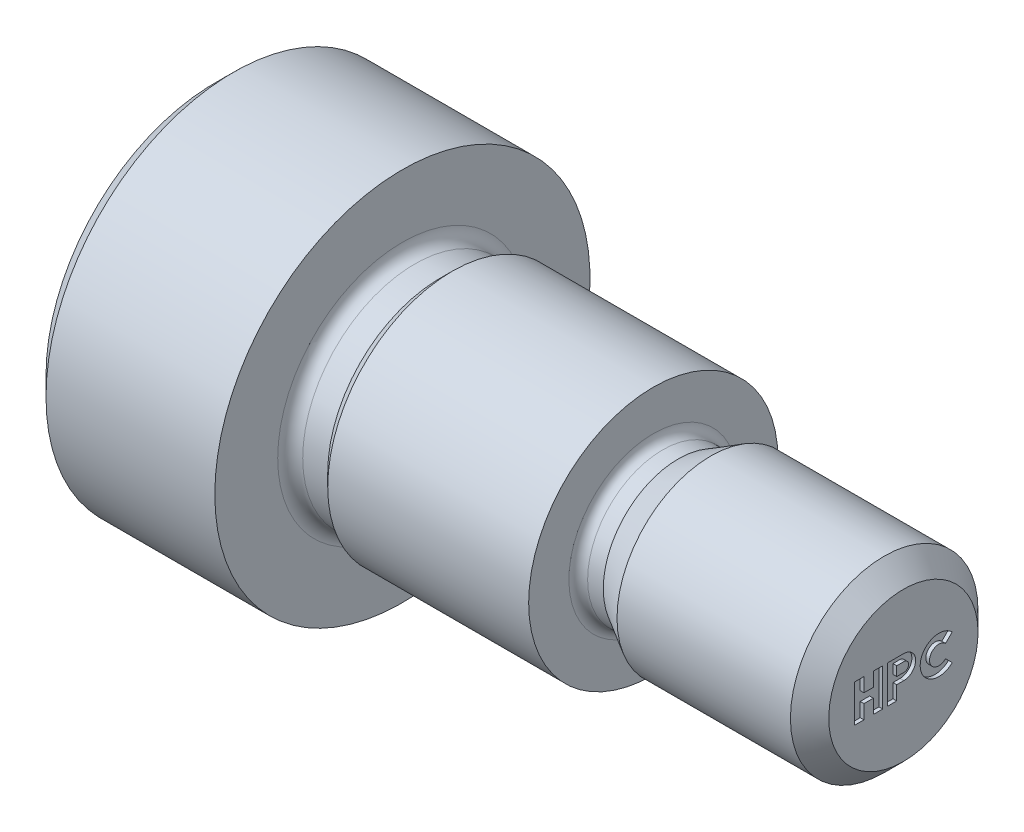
ISO-10303-21;
HEADER;
FILE_DESCRIPTION(('STEP AP214'),'2;1');
FILE_NAME('part.step','',(''),(''),'','','');
FILE_SCHEMA(('AUTOMOTIVE_DESIGN { 1 0 10303 214 1 1 1 1 }'));
ENDSEC;
DATA;
#1=APPLICATION_CONTEXT('core data for automotive mechanical design processes');
#2=APPLICATION_PROTOCOL_DEFINITION('international standard','automotive_design',2000,#1);
#3=PRODUCT_CONTEXT('',#1,'mechanical');
#4=PRODUCT('Part','Part','',(#3));
#5=PRODUCT_RELATED_PRODUCT_CATEGORY('part','',(#4));
#6=PRODUCT_DEFINITION_FORMATION('','',#4);
#7=PRODUCT_DEFINITION_CONTEXT('part definition',#1,'design');
#8=PRODUCT_DEFINITION('design','',#6,#7);
#9=PRODUCT_DEFINITION_SHAPE('','',#8);
#10=(LENGTH_UNIT() NAMED_UNIT(*) SI_UNIT(.MILLI.,.METRE.));
#11=(NAMED_UNIT(*) PLANE_ANGLE_UNIT() SI_UNIT($,.RADIAN.));
#12=(NAMED_UNIT(*) SI_UNIT($,.STERADIAN.) SOLID_ANGLE_UNIT());
#13=UNCERTAINTY_MEASURE_WITH_UNIT(LENGTH_MEASURE(1.E-05),#10,'distance_accuracy_value','');
#14=(GEOMETRIC_REPRESENTATION_CONTEXT(3) GLOBAL_UNCERTAINTY_ASSIGNED_CONTEXT((#13)) GLOBAL_UNIT_ASSIGNED_CONTEXT((#10,
#11,#12)) REPRESENTATION_CONTEXT('',''));
#15=CARTESIAN_POINT('',(0.,0.,0.));
#16=DIRECTION('',(0.,0.,1.));
#17=DIRECTION('',(1.,0.,0.));
#18=AXIS2_PLACEMENT_3D('',#15,#16,#17);
#19=CARTESIAN_POINT('',(8.013,1.1935,0.));
#20=DIRECTION('',(-1.,0.,0.));
#21=DIRECTION('',(0.,0.,1.));
#22=AXIS2_PLACEMENT_3D('',#19,#20,#21);
#23=PLANE('',#22);
#24=DIRECTION('',(0.,-1.,0.));
#25=VECTOR('',#24,1.);
#26=CARTESIAN_POINT('',(8.013,0.1875,0.106066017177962));
#27=LINE('',#26,#25);
#28=CARTESIAN_POINT('',(8.013,0.0375000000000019,0.106066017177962));
#29=VERTEX_POINT('',#28);
#30=CARTESIAN_POINT('',(8.013,0.1875,0.106066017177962));
#31=VERTEX_POINT('',#30);
#32=EDGE_CURVE('E147',#29,#31,#27,.F.);
#33=ORIENTED_EDGE('',*,*,#32,.F.);
#34=DIRECTION('',(0.,0.,-1.));
#35=VECTOR('',#34,1.);
#36=CARTESIAN_POINT('',(8.013,0.0375000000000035,0.106066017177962));
#37=LINE('',#36,#35);
#38=CARTESIAN_POINT('',(8.013,0.0375,-0.00796837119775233));
#39=VERTEX_POINT('',#38);
#40=EDGE_CURVE('E184',#39,#29,#37,.F.);
#41=ORIENTED_EDGE('',*,*,#40,.F.);
#42=CARTESIAN_POINT('',(8.013,0.1125,-0.00796837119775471));
#43=DIRECTION('',(-1.,0.,0.));
#44=DIRECTION('',(0.,0.,1.));
#45=AXIS2_PLACEMENT_3D('',#42,#43,#44);
#46=CIRCLE('',#45,0.075);
#47=CARTESIAN_POINT('',(8.013,0.1875,-0.00796837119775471));
#48=VERTEX_POINT('',#47);
#49=EDGE_CURVE('E21',#48,#39,#46,.T.);
#50=ORIENTED_EDGE('',*,*,#49,.F.);
#51=DIRECTION('',(0.,0.,1.));
#52=VECTOR('',#51,1.);
#53=CARTESIAN_POINT('',(8.013,0.1875,-0.00796837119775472));
#54=LINE('',#53,#52);
#55=EDGE_CURVE('E138',#31,#48,#54,.F.);
#56=ORIENTED_EDGE('',*,*,#55,.F.);
#57=EDGE_LOOP('',(#33,#41,#50,#56));
#58=FACE_BOUND('',#57,.T.);
#59=ADVANCED_FACE('F17',(#58),#23,.F.);
#60=CARTESIAN_POINT('',(7.953,0.0375000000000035,0.106066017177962));
#61=DIRECTION('',(0.,-1.,0.));
#62=DIRECTION('',(0.,0.,-1.));
#63=AXIS2_PLACEMENT_3D('',#60,#61,#62);
#64=PLANE('',#63);
#65=ORIENTED_EDGE('',*,*,#40,.T.);
#66=DIRECTION('',(1.,0.,0.));
#67=VECTOR('',#66,1.);
#68=CARTESIAN_POINT('',(7.953,0.0375000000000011,0.106066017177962));
#69=LINE('',#68,#67);
#70=CARTESIAN_POINT('',(7.953,0.0375000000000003,0.106066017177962));
#71=VERTEX_POINT('',#70);
#72=EDGE_CURVE('E153',#71,#29,#69,.T.);
#73=ORIENTED_EDGE('',*,*,#72,.F.);
#74=DIRECTION('',(0.,0.,-1.));
#75=VECTOR('',#74,1.);
#76=CARTESIAN_POINT('',(7.953,0.0374999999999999,-0.00796839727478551));
#77=LINE('',#76,#75);
#78=CARTESIAN_POINT('',(7.953,0.0375,-0.00796837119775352));
#79=VERTEX_POINT('',#78);
#80=EDGE_CURVE('E174',#79,#71,#77,.F.);
#81=ORIENTED_EDGE('',*,*,#80,.F.);
#82=DIRECTION('',(-1.,0.,0.));
#83=VECTOR('',#82,1.);
#84=CARTESIAN_POINT('',(7.953,0.0375,-0.00796837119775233));
#85=LINE('',#84,#83);
#86=EDGE_CURVE('E176',#39,#79,#85,.T.);
#87=ORIENTED_EDGE('',*,*,#86,.F.);
#88=EDGE_LOOP('',(#65,#73,#81,#87));
#89=FACE_BOUND('',#88,.T.);
#90=ADVANCED_FACE('F680',(#89),#64,.T.);
#91=CARTESIAN_POINT('',(7.953,0.1875,0.106066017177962));
#92=DIRECTION('',(0.,0.,1.));
#93=DIRECTION('',(0.,-1.,0.));
#94=AXIS2_PLACEMENT_3D('',#91,#92,#93);
#95=PLANE('',#94);
#96=ORIENTED_EDGE('',*,*,#32,.T.);
#97=DIRECTION('',(1.,0.,0.));
#98=VECTOR('',#97,1.);
#99=CARTESIAN_POINT('',(7.953,0.1875,0.106066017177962));
#100=LINE('',#99,#98);
#101=CARTESIAN_POINT('',(7.953,0.1875,0.106066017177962));
#102=VERTEX_POINT('',#101);
#103=EDGE_CURVE('E155',#102,#31,#100,.T.);
#104=ORIENTED_EDGE('',*,*,#103,.F.);
#105=DIRECTION('',(0.,1.,0.));
#106=VECTOR('',#105,1.);
#107=CARTESIAN_POINT('',(7.953,0.112500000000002,0.106066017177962));
#108=LINE('',#107,#106);
#109=EDGE_CURVE('E159',#71,#102,#108,.T.);
#110=ORIENTED_EDGE('',*,*,#109,.F.);
#111=ORIENTED_EDGE('',*,*,#72,.T.);
#112=EDGE_LOOP('',(#96,#104,#110,#111));
#113=FACE_BOUND('',#112,.T.);
#114=ADVANCED_FACE('F157',(#113),#95,.T.);
#115=CARTESIAN_POINT('',(7.953,0.1875,-0.00796837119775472));
#116=DIRECTION('',(0.,1.,0.));
#117=DIRECTION('',(0.,0.,1.));
#118=AXIS2_PLACEMENT_3D('',#115,#116,#117);
#119=PLANE('',#118);
#120=ORIENTED_EDGE('',*,*,#55,.T.);
#121=DIRECTION('',(-1.,0.,0.));
#122=VECTOR('',#121,1.);
#123=CARTESIAN_POINT('',(7.953,0.1875,-0.00796837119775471));
#124=LINE('',#123,#122);
#125=CARTESIAN_POINT('',(7.953,0.1875,-0.00796837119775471));
#126=VERTEX_POINT('',#125);
#127=EDGE_CURVE('E166',#126,#48,#124,.F.);
#128=ORIENTED_EDGE('',*,*,#127,.F.);
#129=DIRECTION('',(0.,0.,-1.));
#130=VECTOR('',#129,1.);
#131=CARTESIAN_POINT('',(7.953,0.1875,-0.00796839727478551));
#132=LINE('',#131,#130);
#133=EDGE_CURVE('E163',#102,#126,#132,.T.);
#134=ORIENTED_EDGE('',*,*,#133,.F.);
#135=ORIENTED_EDGE('',*,*,#103,.T.);
#136=EDGE_LOOP('',(#120,#128,#134,#135));
#137=FACE_BOUND('',#136,.T.);
#138=ADVANCED_FACE('F164',(#137),#119,.T.);
#139=CARTESIAN_POINT('',(7.953,0.1125,-0.00796837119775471));
#140=DIRECTION('',(-1.,0.,0.));
#141=DIRECTION('',(0.,0.,1.));
#142=AXIS2_PLACEMENT_3D('',#139,#140,#141);
#143=CYLINDRICAL_SURFACE('',#142,0.075);
#144=ORIENTED_EDGE('',*,*,#49,.T.);
#145=ORIENTED_EDGE('',*,*,#86,.T.);
#146=CARTESIAN_POINT('',(7.953,0.1125,-0.00796837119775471));
#147=DIRECTION('',(-1.,0.,0.));
#148=DIRECTION('',(0.,0.,1.));
#149=AXIS2_PLACEMENT_3D('',#146,#147,#148);
#150=CIRCLE('',#149,0.075);
#151=EDGE_CURVE('E170',#126,#79,#150,.T.);
#152=ORIENTED_EDGE('',*,*,#151,.F.);
#153=ORIENTED_EDGE('',*,*,#127,.T.);
#154=EDGE_LOOP('',(#144,#145,#152,#153));
#155=FACE_BOUND('',#154,.T.);
#156=ADVANCED_FACE('F677',(#155),#143,.T.);
#157=CARTESIAN_POINT('',(7.953,0.,0.));
#158=DIRECTION('',(1.,0.,0.));
#159=DIRECTION('',(0.,0.,-1.));
#160=AXIS2_PLACEMENT_3D('',#157,#158,#159);
#161=PLANE('',#160);
#162=DIRECTION('',(0.,0.,1.));
#163=VECTOR('',#162,1.);
#164=CARTESIAN_POINT('',(7.953,0.299999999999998,0.330745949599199));
#165=LINE('',#164,#163);
#166=CARTESIAN_POINT('',(7.953,0.299999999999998,0.330745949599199));
#167=VERTEX_POINT('',#166);
#168=CARTESIAN_POINT('',(7.953,0.300000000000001,0.480745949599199));
#169=VERTEX_POINT('',#168);
#170=EDGE_CURVE('E601',#167,#169,#165,.T.);
#171=ORIENTED_EDGE('',*,*,#170,.T.);
#172=DIRECTION('',(0.,1.,0.));
#173=VECTOR('',#172,1.);
#174=CARTESIAN_POINT('',(7.953,0.300000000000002,0.480745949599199));
#175=LINE('',#174,#173);
#176=CARTESIAN_POINT('',(7.953,0.0750000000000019,0.480745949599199));
#177=VERTEX_POINT('',#176);
#178=EDGE_CURVE('E595',#169,#177,#175,.F.);
#179=ORIENTED_EDGE('',*,*,#178,.T.);
#180=DIRECTION('',(0.,0.,1.));
#181=VECTOR('',#180,1.);
#182=CARTESIAN_POINT('',(7.953,0.0750000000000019,0.480745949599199));
#183=LINE('',#182,#181);
#184=CARTESIAN_POINT('',(7.953,0.0750000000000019,0.630745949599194));
#185=VERTEX_POINT('',#184);
#186=EDGE_CURVE('E589',#177,#185,#183,.T.);
#187=ORIENTED_EDGE('',*,*,#186,.T.);
#188=DIRECTION('',(0.,1.,0.));
#189=VECTOR('',#188,1.);
#190=CARTESIAN_POINT('',(7.953,0.0750000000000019,0.630745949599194));
#191=LINE('',#190,#189);
#192=CARTESIAN_POINT('',(7.953,0.300000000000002,0.630745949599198));
#193=VERTEX_POINT('',#192);
#194=EDGE_CURVE('E583',#185,#193,#191,.T.);
#195=ORIENTED_EDGE('',*,*,#194,.T.);
#196=DIRECTION('',(0.,0.,1.));
#197=VECTOR('',#196,1.);
#198=CARTESIAN_POINT('',(7.953,0.300000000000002,0.6307459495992));
#199=LINE('',#198,#197);
#200=CARTESIAN_POINT('',(7.953,0.3,0.7807459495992));
#201=VERTEX_POINT('',#200);
#202=EDGE_CURVE('E577',#193,#201,#199,.T.);
#203=ORIENTED_EDGE('',*,*,#202,.T.);
#204=DIRECTION('',(0.,1.,0.));
#205=VECTOR('',#204,1.);
#206=CARTESIAN_POINT('',(7.953,0.299999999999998,0.7807459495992));
#207=LINE('',#206,#205);
#208=CARTESIAN_POINT('',(7.953,-0.299999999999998,0.7807459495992));
#209=VERTEX_POINT('',#208);
#210=EDGE_CURVE('E643',#201,#209,#207,.F.);
#211=ORIENTED_EDGE('',*,*,#210,.T.);
#212=DIRECTION('',(0.,0.,-1.));
#213=VECTOR('',#212,1.);
#214=CARTESIAN_POINT('',(7.953,-0.299999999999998,0.7807459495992));
#215=LINE('',#214,#213);
#216=CARTESIAN_POINT('',(7.953,-0.299999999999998,0.6307459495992));
#217=VERTEX_POINT('',#216);
#218=EDGE_CURVE('E637',#209,#217,#215,.T.);
#219=ORIENTED_EDGE('',*,*,#218,.T.);
#220=DIRECTION('',(0.,1.,0.));
#221=VECTOR('',#220,1.);
#222=CARTESIAN_POINT('',(7.953,-0.299999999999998,0.6307459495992));
#223=LINE('',#222,#221);
#224=CARTESIAN_POINT('',(7.953,-0.0749999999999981,0.630745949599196));
#225=VERTEX_POINT('',#224);
#226=EDGE_CURVE('E631',#217,#225,#223,.T.);
#227=ORIENTED_EDGE('',*,*,#226,.T.);
#228=DIRECTION('',(0.,0.,-1.));
#229=VECTOR('',#228,1.);
#230=CARTESIAN_POINT('',(7.953,-0.0749999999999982,0.630745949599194));
#231=LINE('',#230,#229);
#232=CARTESIAN_POINT('',(7.953,-0.0749999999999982,0.480745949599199));
#233=VERTEX_POINT('',#232);
#234=EDGE_CURVE('E625',#225,#233,#231,.T.);
#235=ORIENTED_EDGE('',*,*,#234,.T.);
#236=DIRECTION('',(0.,1.,0.));
#237=VECTOR('',#236,1.);
#238=CARTESIAN_POINT('',(7.953,-0.0749999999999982,0.480745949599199));
#239=LINE('',#238,#237);
#240=CARTESIAN_POINT('',(7.953,-0.300000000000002,0.480745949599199));
#241=VERTEX_POINT('',#240);
#242=EDGE_CURVE('E619',#233,#241,#239,.F.);
#243=ORIENTED_EDGE('',*,*,#242,.T.);
#244=DIRECTION('',(0.,0.,-1.));
#245=VECTOR('',#244,1.);
#246=CARTESIAN_POINT('',(7.953,-0.300000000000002,0.480745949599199));
#247=LINE('',#246,#245);
#248=CARTESIAN_POINT('',(7.953,-0.3,0.330745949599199));
#249=VERTEX_POINT('',#248);
#250=EDGE_CURVE('E613',#241,#249,#247,.T.);
#251=ORIENTED_EDGE('',*,*,#250,.T.);
#252=DIRECTION('',(0.,1.,0.));
#253=VECTOR('',#252,1.);
#254=CARTESIAN_POINT('',(7.953,-0.299999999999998,0.330745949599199));
#255=LINE('',#254,#253);
#256=EDGE_CURVE('E607',#249,#167,#255,.T.);
#257=ORIENTED_EDGE('',*,*,#256,.T.);
#258=EDGE_LOOP('',(#171,#179,#187,#195,#203,#211,#219,#227,#235,#243,#251,#257));
#259=FACE_BOUND('',#258,.T.);
#260=ADVANCED_FACE('F852',(#259),#161,.T.);
#261=CARTESIAN_POINT('',(7.953,0.,-0.568613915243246));
#262=DIRECTION('',(1.,0.,0.));
#263=DIRECTION('',(0.,0.,-1.));
#264=AXIS2_PLACEMENT_3D('',#261,#262,#263);
#265=PLANE('',#264);
#266=DIRECTION('',(0.,0.707106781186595,-0.7071067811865));
#267=VECTOR('',#266,1.);
#268=CARTESIAN_POINT('',(7.953,0.106066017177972,-0.674679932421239));
#269=LINE('',#268,#267);
#270=CARTESIAN_POINT('',(7.953,0.106066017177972,-0.674679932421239));
#271=VERTEX_POINT('',#270);
#272=CARTESIAN_POINT('',(7.953,0.212132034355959,-0.780745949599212));
#273=VERTEX_POINT('',#272);
#274=EDGE_CURVE('E561',#271,#273,#269,.T.);
#275=ORIENTED_EDGE('',*,*,#274,.T.);
#276=CARTESIAN_POINT('',(7.953,0.,-0.568613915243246));
#277=DIRECTION('',(-1.,0.,0.));
#278=DIRECTION('',(0.,0.,1.));
#279=AXIS2_PLACEMENT_3D('',#276,#277,#278);
#280=CIRCLE('',#279,0.3);
#281=CARTESIAN_POINT('',(7.953,-0.212132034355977,-0.780745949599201));
#282=VERTEX_POINT('',#281);
#283=EDGE_CURVE('E573',#273,#282,#280,.F.);
#284=ORIENTED_EDGE('',*,*,#283,.T.);
#285=DIRECTION('',(0.,0.707106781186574,0.707106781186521));
#286=VECTOR('',#285,1.);
#287=CARTESIAN_POINT('',(7.953,-0.212132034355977,-0.780745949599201));
#288=LINE('',#287,#286);
#289=CARTESIAN_POINT('',(7.953,-0.106066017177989,-0.674679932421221));
#290=VERTEX_POINT('',#289);
#291=EDGE_CURVE('E569',#282,#290,#288,.T.);
#292=ORIENTED_EDGE('',*,*,#291,.T.);
#293=CARTESIAN_POINT('',(7.953,0.,-0.568613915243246));
#294=DIRECTION('',(-1.,0.,0.));
#295=DIRECTION('',(0.,0.,1.));
#296=AXIS2_PLACEMENT_3D('',#293,#294,#295);
#297=CIRCLE('',#296,0.15);
#298=EDGE_CURVE('E562',#271,#290,#297,.F.);
#299=ORIENTED_EDGE('',*,*,#298,.F.);
#300=EDGE_LOOP('',(#275,#284,#292,#299));
#301=FACE_BOUND('',#300,.T.);
#302=ADVANCED_FACE('F725',(#301),#265,.T.);
#303=CARTESIAN_POINT('',(7.953,0.112500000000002,-0.00796839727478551));
#304=DIRECTION('',(1.,0.,0.));
#305=DIRECTION('',(0.,0.,-1.));
#306=AXIS2_PLACEMENT_3D('',#303,#304,#305);
#307=PLANE('',#306);
#308=ORIENTED_EDGE('',*,*,#133,.T.);
#309=ORIENTED_EDGE('',*,*,#151,.T.);
#310=ORIENTED_EDGE('',*,*,#80,.T.);
#311=ORIENTED_EDGE('',*,*,#109,.T.);
#312=EDGE_LOOP('',(#308,#309,#310,#311));
#313=FACE_BOUND('',#312,.T.);
#314=DIRECTION('',(0.,0.,-1.));
#315=VECTOR('',#314,1.);
#316=CARTESIAN_POINT('',(7.953,-0.299999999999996,0.256066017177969));
#317=LINE('',#316,#315);
#318=CARTESIAN_POINT('',(7.953,-0.299999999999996,0.256066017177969));
#319=VERTEX_POINT('',#318);
#320=CARTESIAN_POINT('',(7.953,-0.299999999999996,0.106066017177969));
#321=VERTEX_POINT('',#320);
#322=EDGE_CURVE('E535',#319,#321,#317,.T.);
#323=ORIENTED_EDGE('',*,*,#322,.T.);
#324=DIRECTION('',(0.,1.,0.));
#325=VECTOR('',#324,1.);
#326=CARTESIAN_POINT('',(7.953,-0.299999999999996,0.106066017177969));
#327=LINE('',#326,#325);
#328=CARTESIAN_POINT('',(7.953,-0.075,0.106066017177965));
#329=VERTEX_POINT('',#328);
#330=EDGE_CURVE('E524',#321,#329,#327,.T.);
#331=ORIENTED_EDGE('',*,*,#330,.T.);
#332=DIRECTION('',(0.,0.,-1.));
#333=VECTOR('',#332,1.);
#334=CARTESIAN_POINT('',(7.953,-0.075,0.106066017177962));
#335=LINE('',#334,#333);
#336=CARTESIAN_POINT('',(7.953,-0.0749999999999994,-0.00796839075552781));
#337=VERTEX_POINT('',#336);
#338=EDGE_CURVE('E520',#329,#337,#335,.T.);
#339=ORIENTED_EDGE('',*,*,#338,.T.);
#340=CARTESIAN_POINT('',(7.953,0.112500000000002,-0.00796839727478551));
#341=DIRECTION('',(-1.,0.,0.));
#342=DIRECTION('',(0.,0.,1.));
#343=AXIS2_PLACEMENT_3D('',#340,#341,#342);
#344=CIRCLE('',#343,0.1875);
#345=CARTESIAN_POINT('',(7.953,0.300000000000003,-0.00796839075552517));
#346=VERTEX_POINT('',#345);
#347=EDGE_CURVE('E516',#337,#346,#344,.F.);
#348=ORIENTED_EDGE('',*,*,#347,.T.);
#349=DIRECTION('',(0.,0.,1.));
#350=VECTOR('',#349,1.);
#351=CARTESIAN_POINT('',(7.953,0.300000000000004,-0.00796837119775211));
#352=LINE('',#351,#350);
#353=CARTESIAN_POINT('',(7.953,0.300000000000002,0.256066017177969));
#354=VERTEX_POINT('',#353);
#355=EDGE_CURVE('E555',#346,#354,#352,.T.);
#356=ORIENTED_EDGE('',*,*,#355,.T.);
#357=DIRECTION('',(0.,1.,0.));
#358=VECTOR('',#357,1.);
#359=CARTESIAN_POINT('',(7.953,0.3,0.256066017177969));
#360=LINE('',#359,#358);
#361=EDGE_CURVE('E545',#354,#319,#360,.F.);
#362=ORIENTED_EDGE('',*,*,#361,.T.);
#363=EDGE_LOOP('',(#323,#331,#339,#348,#356,#362));
#364=FACE_BOUND('',#363,.T.);
#365=ADVANCED_FACE('F172',(#313,#364),#307,.T.);
#366=CARTESIAN_POINT('',(7.953,0.299999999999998,0.7807459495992));
#367=DIRECTION('',(0.,0.,1.));
#368=DIRECTION('',(1.,0.,0.));
#369=AXIS2_PLACEMENT_3D('',#366,#367,#368);
#370=PLANE('',#369);
#371=ORIENTED_EDGE('',*,*,#210,.F.);
#372=DIRECTION('',(1.,0.,0.));
#373=VECTOR('',#372,1.);
#374=CARTESIAN_POINT('',(7.953,0.299999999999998,0.7807459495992));
#375=LINE('',#374,#373);
#376=CARTESIAN_POINT('',(8.013,0.3,0.7807459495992));
#377=VERTEX_POINT('',#376);
#378=EDGE_CURVE('E574',#201,#377,#375,.T.);
#379=ORIENTED_EDGE('',*,*,#378,.T.);
#380=DIRECTION('',(0.,1.,0.));
#381=VECTOR('',#380,1.);
#382=CARTESIAN_POINT('',(8.013,1.1935,0.7807459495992));
#383=LINE('',#382,#381);
#384=CARTESIAN_POINT('',(8.013,-0.299999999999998,0.7807459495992));
#385=VERTEX_POINT('',#384);
#386=EDGE_CURVE('E511',#377,#385,#383,.F.);
#387=ORIENTED_EDGE('',*,*,#386,.T.);
#388=DIRECTION('',(1.,0.,0.));
#389=VECTOR('',#388,1.);
#390=CARTESIAN_POINT('',(7.953,-0.299999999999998,0.7807459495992));
#391=LINE('',#390,#389);
#392=EDGE_CURVE('E640',#385,#209,#391,.F.);
#393=ORIENTED_EDGE('',*,*,#392,.T.);
#394=EDGE_LOOP('',(#371,#379,#387,#393));
#395=FACE_BOUND('',#394,.T.);
#396=ADVANCED_FACE('F843',(#395),#370,.F.);
#397=CARTESIAN_POINT('',(7.953,-0.299999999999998,0.7807459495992));
#398=DIRECTION('',(0.,-1.,0.));
#399=DIRECTION('',(0.,0.,-1.));
#400=AXIS2_PLACEMENT_3D('',#397,#398,#399);
#401=PLANE('',#400);
#402=ORIENTED_EDGE('',*,*,#218,.F.);
#403=ORIENTED_EDGE('',*,*,#392,.F.);
#404=DIRECTION('',(0.,0.,1.));
#405=VECTOR('',#404,1.);
#406=CARTESIAN_POINT('',(8.013,-0.299999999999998,0.));
#407=LINE('',#406,#405);
#408=CARTESIAN_POINT('',(8.013,-0.299999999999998,0.6307459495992));
#409=VERTEX_POINT('',#408);
#410=EDGE_CURVE('E508',#385,#409,#407,.F.);
#411=ORIENTED_EDGE('',*,*,#410,.T.);
#412=DIRECTION('',(1.,0.,0.));
#413=VECTOR('',#412,1.);
#414=CARTESIAN_POINT('',(7.953,-0.299999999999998,0.6307459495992));
#415=LINE('',#414,#413);
#416=EDGE_CURVE('E634',#409,#217,#415,.F.);
#417=ORIENTED_EDGE('',*,*,#416,.T.);
#418=EDGE_LOOP('',(#402,#403,#411,#417));
#419=FACE_BOUND('',#418,.T.);
#420=ADVANCED_FACE('F839',(#419),#401,.F.);
#421=CARTESIAN_POINT('',(7.953,-0.299999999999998,0.6307459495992));
#422=DIRECTION('',(0.,0.,-1.));
#423=DIRECTION('',(0.,1.,0.));
#424=AXIS2_PLACEMENT_3D('',#421,#422,#423);
#425=PLANE('',#424);
#426=ORIENTED_EDGE('',*,*,#226,.F.);
#427=ORIENTED_EDGE('',*,*,#416,.F.);
#428=DIRECTION('',(0.,1.,0.));
#429=VECTOR('',#428,1.);
#430=CARTESIAN_POINT('',(8.013,1.1935,0.6307459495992));
#431=LINE('',#430,#429);
#432=CARTESIAN_POINT('',(8.013,-0.0749999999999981,0.630745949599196));
#433=VERTEX_POINT('',#432);
#434=EDGE_CURVE('E505',#409,#433,#431,.T.);
#435=ORIENTED_EDGE('',*,*,#434,.T.);
#436=DIRECTION('',(1.,0.,0.));
#437=VECTOR('',#436,1.);
#438=CARTESIAN_POINT('',(7.953,-0.0749999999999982,0.630745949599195));
#439=LINE('',#438,#437);
#440=EDGE_CURVE('E628',#433,#225,#439,.F.);
#441=ORIENTED_EDGE('',*,*,#440,.T.);
#442=EDGE_LOOP('',(#426,#427,#435,#441));
#443=FACE_BOUND('',#442,.T.);
#444=ADVANCED_FACE('F835',(#443),#425,.F.);
#445=CARTESIAN_POINT('',(7.953,-0.0749999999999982,0.630745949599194));
#446=DIRECTION('',(0.,-1.,0.));
#447=DIRECTION('',(0.,0.,-1.));
#448=AXIS2_PLACEMENT_3D('',#445,#446,#447);
#449=PLANE('',#448);
#450=ORIENTED_EDGE('',*,*,#234,.F.);
#451=ORIENTED_EDGE('',*,*,#440,.F.);
#452=DIRECTION('',(0.,0.,1.));
#453=VECTOR('',#452,1.);
#454=CARTESIAN_POINT('',(8.013,-0.074999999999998,0.));
#455=LINE('',#454,#453);
#456=CARTESIAN_POINT('',(8.013,-0.0749999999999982,0.480745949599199));
#457=VERTEX_POINT('',#456);
#458=EDGE_CURVE('E502',#433,#457,#455,.F.);
#459=ORIENTED_EDGE('',*,*,#458,.T.);
#460=DIRECTION('',(1.,0.,0.));
#461=VECTOR('',#460,1.);
#462=CARTESIAN_POINT('',(7.953,-0.0749999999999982,0.480745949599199));
#463=LINE('',#462,#461);
#464=EDGE_CURVE('E622',#457,#233,#463,.F.);
#465=ORIENTED_EDGE('',*,*,#464,.T.);
#466=EDGE_LOOP('',(#450,#451,#459,#465));
#467=FACE_BOUND('',#466,.T.);
#468=ADVANCED_FACE('F831',(#467),#449,.F.);
#469=CARTESIAN_POINT('',(7.953,-0.0749999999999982,0.480745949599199));
#470=DIRECTION('',(0.,0.,1.));
#471=DIRECTION('',(1.,0.,0.));
#472=AXIS2_PLACEMENT_3D('',#469,#470,#471);
#473=PLANE('',#472);
#474=ORIENTED_EDGE('',*,*,#242,.F.);
#475=ORIENTED_EDGE('',*,*,#464,.F.);
#476=DIRECTION('',(0.,1.,0.));
#477=VECTOR('',#476,1.);
#478=CARTESIAN_POINT('',(8.013,1.1935,0.480745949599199));
#479=LINE('',#478,#477);
#480=CARTESIAN_POINT('',(8.013,-0.300000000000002,0.480745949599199));
#481=VERTEX_POINT('',#480);
#482=EDGE_CURVE('E499',#457,#481,#479,.F.);
#483=ORIENTED_EDGE('',*,*,#482,.T.);
#484=DIRECTION('',(1.,0.,0.));
#485=VECTOR('',#484,1.);
#486=CARTESIAN_POINT('',(7.953,-0.300000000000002,0.480745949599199));
#487=LINE('',#486,#485);
#488=EDGE_CURVE('E616',#481,#241,#487,.F.);
#489=ORIENTED_EDGE('',*,*,#488,.T.);
#490=EDGE_LOOP('',(#474,#475,#483,#489));
#491=FACE_BOUND('',#490,.T.);
#492=ADVANCED_FACE('F827',(#491),#473,.F.);
#493=CARTESIAN_POINT('',(7.953,-0.300000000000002,0.480745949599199));
#494=DIRECTION('',(0.,-1.,0.));
#495=DIRECTION('',(0.,0.,-1.));
#496=AXIS2_PLACEMENT_3D('',#493,#494,#495);
#497=PLANE('',#496);
#498=ORIENTED_EDGE('',*,*,#250,.F.);
#499=ORIENTED_EDGE('',*,*,#488,.F.);
#500=DIRECTION('',(0.,0.,1.));
#501=VECTOR('',#500,1.);
#502=CARTESIAN_POINT('',(8.013,-0.300000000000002,0.));
#503=LINE('',#502,#501);
#504=CARTESIAN_POINT('',(8.013,-0.3,0.330745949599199));
#505=VERTEX_POINT('',#504);
#506=EDGE_CURVE('E496',#481,#505,#503,.F.);
#507=ORIENTED_EDGE('',*,*,#506,.T.);
#508=DIRECTION('',(-1.,0.,0.));
#509=VECTOR('',#508,1.);
#510=CARTESIAN_POINT('',(7.953,-0.299999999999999,0.330745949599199));
#511=LINE('',#510,#509);
#512=EDGE_CURVE('E610',#505,#249,#511,.T.);
#513=ORIENTED_EDGE('',*,*,#512,.T.);
#514=EDGE_LOOP('',(#498,#499,#507,#513));
#515=FACE_BOUND('',#514,.T.);
#516=ADVANCED_FACE('F823',(#515),#497,.F.);
#517=CARTESIAN_POINT('',(7.953,-0.299999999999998,0.330745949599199));
#518=DIRECTION('',(0.,0.,-1.));
#519=DIRECTION('',(-1.,0.,0.));
#520=AXIS2_PLACEMENT_3D('',#517,#518,#519);
#521=PLANE('',#520);
#522=ORIENTED_EDGE('',*,*,#256,.F.);
#523=ORIENTED_EDGE('',*,*,#512,.F.);
#524=DIRECTION('',(0.,1.,0.));
#525=VECTOR('',#524,1.);
#526=CARTESIAN_POINT('',(8.013,1.1935,0.330745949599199));
#527=LINE('',#526,#525);
#528=CARTESIAN_POINT('',(8.013,0.299999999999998,0.330745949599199));
#529=VERTEX_POINT('',#528);
#530=EDGE_CURVE('E493',#505,#529,#527,.T.);
#531=ORIENTED_EDGE('',*,*,#530,.T.);
#532=DIRECTION('',(1.,0.,0.));
#533=VECTOR('',#532,1.);
#534=CARTESIAN_POINT('',(7.953,0.299999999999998,0.330745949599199));
#535=LINE('',#534,#533);
#536=EDGE_CURVE('E604',#529,#167,#535,.F.);
#537=ORIENTED_EDGE('',*,*,#536,.T.);
#538=EDGE_LOOP('',(#522,#523,#531,#537));
#539=FACE_BOUND('',#538,.T.);
#540=ADVANCED_FACE('F819',(#539),#521,.F.);
#541=CARTESIAN_POINT('',(7.953,0.299999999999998,0.330745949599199));
#542=DIRECTION('',(0.,1.,0.));
#543=DIRECTION('',(0.,0.,1.));
#544=AXIS2_PLACEMENT_3D('',#541,#542,#543);
#545=PLANE('',#544);
#546=ORIENTED_EDGE('',*,*,#170,.F.);
#547=ORIENTED_EDGE('',*,*,#536,.F.);
#548=DIRECTION('',(0.,0.,1.));
#549=VECTOR('',#548,1.);
#550=CARTESIAN_POINT('',(8.013,0.299999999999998,0.));
#551=LINE('',#550,#549);
#552=CARTESIAN_POINT('',(8.013,0.300000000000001,0.480745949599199));
#553=VERTEX_POINT('',#552);
#554=EDGE_CURVE('E490',#529,#553,#551,.T.);
#555=ORIENTED_EDGE('',*,*,#554,.T.);
#556=DIRECTION('',(1.,0.,0.));
#557=VECTOR('',#556,1.);
#558=CARTESIAN_POINT('',(7.953,0.300000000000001,0.480745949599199));
#559=LINE('',#558,#557);
#560=EDGE_CURVE('E598',#553,#169,#559,.F.);
#561=ORIENTED_EDGE('',*,*,#560,.T.);
#562=EDGE_LOOP('',(#546,#547,#555,#561));
#563=FACE_BOUND('',#562,.T.);
#564=ADVANCED_FACE('F815',(#563),#545,.F.);
#565=CARTESIAN_POINT('',(7.953,0.300000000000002,0.480745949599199));
#566=DIRECTION('',(0.,0.,1.));
#567=DIRECTION('',(1.,0.,0.));
#568=AXIS2_PLACEMENT_3D('',#565,#566,#567);
#569=PLANE('',#568);
#570=ORIENTED_EDGE('',*,*,#178,.F.);
#571=ORIENTED_EDGE('',*,*,#560,.F.);
#572=DIRECTION('',(0.,1.,0.));
#573=VECTOR('',#572,1.);
#574=CARTESIAN_POINT('',(8.013,1.1935,0.480745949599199));
#575=LINE('',#574,#573);
#576=CARTESIAN_POINT('',(8.013,0.0750000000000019,0.480745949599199));
#577=VERTEX_POINT('',#576);
#578=EDGE_CURVE('E487',#553,#577,#575,.F.);
#579=ORIENTED_EDGE('',*,*,#578,.T.);
#580=DIRECTION('',(1.,0.,0.));
#581=VECTOR('',#580,1.);
#582=CARTESIAN_POINT('',(7.953,0.0750000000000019,0.480745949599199));
#583=LINE('',#582,#581);
#584=EDGE_CURVE('E592',#577,#177,#583,.F.);
#585=ORIENTED_EDGE('',*,*,#584,.T.);
#586=EDGE_LOOP('',(#570,#571,#579,#585));
#587=FACE_BOUND('',#586,.T.);
#588=ADVANCED_FACE('F811',(#587),#569,.F.);
#589=CARTESIAN_POINT('',(7.953,0.0750000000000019,0.480745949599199));
#590=DIRECTION('',(0.,1.,0.));
#591=DIRECTION('',(0.,0.,1.));
#592=AXIS2_PLACEMENT_3D('',#589,#590,#591);
#593=PLANE('',#592);
#594=ORIENTED_EDGE('',*,*,#186,.F.);
#595=ORIENTED_EDGE('',*,*,#584,.F.);
#596=DIRECTION('',(0.,0.,1.));
#597=VECTOR('',#596,1.);
#598=CARTESIAN_POINT('',(8.013,0.0750000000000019,0.));
#599=LINE('',#598,#597);
#600=CARTESIAN_POINT('',(8.013,0.0750000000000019,0.630745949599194));
#601=VERTEX_POINT('',#600);
#602=EDGE_CURVE('E484',#577,#601,#599,.T.);
#603=ORIENTED_EDGE('',*,*,#602,.T.);
#604=DIRECTION('',(1.,0.,0.));
#605=VECTOR('',#604,1.);
#606=CARTESIAN_POINT('',(7.953,0.0750000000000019,0.630745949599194));
#607=LINE('',#606,#605);
#608=EDGE_CURVE('E586',#601,#185,#607,.F.);
#609=ORIENTED_EDGE('',*,*,#608,.T.);
#610=EDGE_LOOP('',(#594,#595,#603,#609));
#611=FACE_BOUND('',#610,.T.);
#612=ADVANCED_FACE('F807',(#611),#593,.F.);
#613=CARTESIAN_POINT('',(7.953,0.0750000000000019,0.630745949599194));
#614=DIRECTION('',(0.,0.,-1.));
#615=DIRECTION('',(0.,1.,0.));
#616=AXIS2_PLACEMENT_3D('',#613,#614,#615);
#617=PLANE('',#616);
#618=ORIENTED_EDGE('',*,*,#194,.F.);
#619=ORIENTED_EDGE('',*,*,#608,.F.);
#620=DIRECTION('',(0.,1.,0.));
#621=VECTOR('',#620,1.);
#622=CARTESIAN_POINT('',(8.013,1.1935,0.630745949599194));
#623=LINE('',#622,#621);
#624=CARTESIAN_POINT('',(8.013,0.300000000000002,0.630745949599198));
#625=VERTEX_POINT('',#624);
#626=EDGE_CURVE('E481',#601,#625,#623,.T.);
#627=ORIENTED_EDGE('',*,*,#626,.T.);
#628=DIRECTION('',(1.,0.,0.));
#629=VECTOR('',#628,1.);
#630=CARTESIAN_POINT('',(7.953,0.300000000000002,0.630745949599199));
#631=LINE('',#630,#629);
#632=EDGE_CURVE('E580',#625,#193,#631,.F.);
#633=ORIENTED_EDGE('',*,*,#632,.T.);
#634=EDGE_LOOP('',(#618,#619,#627,#633));
#635=FACE_BOUND('',#634,.T.);
#636=ADVANCED_FACE('F803',(#635),#617,.F.);
#637=CARTESIAN_POINT('',(7.953,0.300000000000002,0.6307459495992));
#638=DIRECTION('',(0.,1.,0.));
#639=DIRECTION('',(0.,0.,1.));
#640=AXIS2_PLACEMENT_3D('',#637,#638,#639);
#641=PLANE('',#640);
#642=ORIENTED_EDGE('',*,*,#202,.F.);
#643=ORIENTED_EDGE('',*,*,#632,.F.);
#644=DIRECTION('',(0.,0.,1.));
#645=VECTOR('',#644,1.);
#646=CARTESIAN_POINT('',(8.013,0.300000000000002,0.));
#647=LINE('',#646,#645);
#648=EDGE_CURVE('E478',#625,#377,#647,.T.);
#649=ORIENTED_EDGE('',*,*,#648,.T.);
#650=ORIENTED_EDGE('',*,*,#378,.F.);
#651=EDGE_LOOP('',(#642,#643,#649,#650));
#652=FACE_BOUND('',#651,.T.);
#653=ADVANCED_FACE('F800',(#652),#641,.F.);
#654=CARTESIAN_POINT('',(7.953,0.,-0.568613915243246));
#655=DIRECTION('',(-1.,0.,0.));
#656=DIRECTION('',(0.,0.,1.));
#657=AXIS2_PLACEMENT_3D('',#654,#655,#656);
#658=CYLINDRICAL_SURFACE('',#657,0.3);
#659=CARTESIAN_POINT('',(8.013,0.,-0.568613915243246));
#660=DIRECTION('',(-1.,0.,0.));
#661=DIRECTION('',(0.,0.,1.));
#662=AXIS2_PLACEMENT_3D('',#659,#660,#661);
#663=CIRCLE('',#662,0.3);
#664=CARTESIAN_POINT('',(8.013,0.212132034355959,-0.780745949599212));
#665=VERTEX_POINT('',#664);
#666=CARTESIAN_POINT('',(8.013,-0.212132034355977,-0.780745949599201));
#667=VERTEX_POINT('',#666);
#668=EDGE_CURVE('E477',#665,#667,#663,.F.);
#669=ORIENTED_EDGE('',*,*,#668,.T.);
#670=DIRECTION('',(1.,0.,0.));
#671=VECTOR('',#670,1.);
#672=CARTESIAN_POINT('',(7.953,-0.212132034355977,-0.780745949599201));
#673=LINE('',#672,#671);
#674=EDGE_CURVE('E570',#667,#282,#673,.F.);
#675=ORIENTED_EDGE('',*,*,#674,.T.);
#676=ORIENTED_EDGE('',*,*,#283,.F.);
#677=DIRECTION('',(1.,0.,0.));
#678=VECTOR('',#677,1.);
#679=CARTESIAN_POINT('',(7.953,0.212132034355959,-0.780745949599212));
#680=LINE('',#679,#678);
#681=EDGE_CURVE('E563',#273,#665,#680,.T.);
#682=ORIENTED_EDGE('',*,*,#681,.T.);
#683=EDGE_LOOP('',(#669,#675,#676,#682));
#684=FACE_BOUND('',#683,.T.);
#685=ADVANCED_FACE('F732',(#684),#658,.F.);
#686=CARTESIAN_POINT('',(7.953,-0.212132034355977,-0.780745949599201));
#687=DIRECTION('',(0.,0.707106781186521,-0.707106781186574));
#688=DIRECTION('',(0.,0.707106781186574,0.707106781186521));
#689=AXIS2_PLACEMENT_3D('',#686,#687,#688);
#690=PLANE('',#689);
#691=ORIENTED_EDGE('',*,*,#291,.F.);
#692=ORIENTED_EDGE('',*,*,#674,.F.);
#693=DIRECTION('',(0.,0.707106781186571,0.707106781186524));
#694=VECTOR('',#693,1.);
#695=CARTESIAN_POINT('',(8.013,-0.212132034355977,-0.780745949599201));
#696=LINE('',#695,#694);
#697=CARTESIAN_POINT('',(8.013,-0.106066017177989,-0.674679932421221));
#698=VERTEX_POINT('',#697);
#699=EDGE_CURVE('E474',#667,#698,#696,.T.);
#700=ORIENTED_EDGE('',*,*,#699,.T.);
#701=DIRECTION('',(-1.,0.,0.));
#702=VECTOR('',#701,1.);
#703=CARTESIAN_POINT('',(7.953,-0.106066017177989,-0.674679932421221));
#704=LINE('',#703,#702);
#705=EDGE_CURVE('E566',#290,#698,#704,.F.);
#706=ORIENTED_EDGE('',*,*,#705,.F.);
#707=EDGE_LOOP('',(#691,#692,#700,#706));
#708=FACE_BOUND('',#707,.T.);
#709=ADVANCED_FACE('F735',(#708),#690,.F.);
#710=CARTESIAN_POINT('',(7.953,0.,-0.568613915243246));
#711=DIRECTION('',(-1.,0.,0.));
#712=DIRECTION('',(0.,0.,1.));
#713=AXIS2_PLACEMENT_3D('',#710,#711,#712);
#714=CYLINDRICAL_SURFACE('',#713,0.15);
#715=DIRECTION('',(1.,0.,0.));
#716=VECTOR('',#715,1.);
#717=CARTESIAN_POINT('',(7.953,0.106066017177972,-0.674679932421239));
#718=LINE('',#717,#716);
#719=CARTESIAN_POINT('',(8.013,0.106066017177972,-0.674679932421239));
#720=VERTEX_POINT('',#719);
#721=EDGE_CURVE('E558',#720,#271,#718,.F.);
#722=ORIENTED_EDGE('',*,*,#721,.T.);
#723=ORIENTED_EDGE('',*,*,#298,.T.);
#724=ORIENTED_EDGE('',*,*,#705,.T.);
#725=CARTESIAN_POINT('',(8.013,0.,-0.568613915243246));
#726=DIRECTION('',(-1.,0.,0.));
#727=DIRECTION('',(0.,0.,1.));
#728=AXIS2_PLACEMENT_3D('',#725,#726,#727);
#729=CIRCLE('',#728,0.15);
#730=EDGE_CURVE('E473',#698,#720,#729,.T.);
#731=ORIENTED_EDGE('',*,*,#730,.T.);
#732=EDGE_LOOP('',(#722,#723,#724,#731));
#733=FACE_BOUND('',#732,.T.);
#734=ADVANCED_FACE('F737',(#733),#714,.T.);
#735=CARTESIAN_POINT('',(7.953,0.106066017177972,-0.674679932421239));
#736=DIRECTION('',(0.,-0.7071067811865,-0.707106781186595));
#737=DIRECTION('',(0.,0.707106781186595,-0.7071067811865));
#738=AXIS2_PLACEMENT_3D('',#735,#736,#737);
#739=PLANE('',#738);
#740=ORIENTED_EDGE('',*,*,#274,.F.);
#741=ORIENTED_EDGE('',*,*,#721,.F.);
#742=DIRECTION('',(0.,0.707106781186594,-0.707106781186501));
#743=VECTOR('',#742,1.);
#744=CARTESIAN_POINT('',(8.013,0.106066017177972,-0.674679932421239));
#745=LINE('',#744,#743);
#746=EDGE_CURVE('E468',#720,#665,#745,.T.);
#747=ORIENTED_EDGE('',*,*,#746,.T.);
#748=ORIENTED_EDGE('',*,*,#681,.F.);
#749=EDGE_LOOP('',(#740,#741,#747,#748));
#750=FACE_BOUND('',#749,.T.);
#751=ADVANCED_FACE('F741',(#750),#739,.F.);
#752=CARTESIAN_POINT('',(7.953,0.300000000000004,-0.00796837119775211));
#753=DIRECTION('',(0.,1.,0.));
#754=DIRECTION('',(0.,0.,1.));
#755=AXIS2_PLACEMENT_3D('',#752,#753,#754);
#756=PLANE('',#755);
#757=DIRECTION('',(1.,0.,0.));
#758=VECTOR('',#757,1.);
#759=CARTESIAN_POINT('',(7.953,0.300000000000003,0.256066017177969));
#760=LINE('',#759,#758);
#761=CARTESIAN_POINT('',(8.013,0.300000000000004,0.256066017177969));
#762=VERTEX_POINT('',#761);
#763=EDGE_CURVE('E552',#762,#354,#760,.F.);
#764=ORIENTED_EDGE('',*,*,#763,.T.);
#765=ORIENTED_EDGE('',*,*,#355,.F.);
#766=DIRECTION('',(-1.,0.,0.));
#767=VECTOR('',#766,1.);
#768=CARTESIAN_POINT('',(7.953,0.300000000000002,-0.00796838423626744));
#769=LINE('',#768,#767);
#770=CARTESIAN_POINT('',(8.013,0.300000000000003,-0.00796839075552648));
#771=VERTEX_POINT('',#770);
#772=EDGE_CURVE('E514',#346,#771,#769,.F.);
#773=ORIENTED_EDGE('',*,*,#772,.T.);
#774=DIRECTION('',(0.,0.,1.));
#775=VECTOR('',#774,1.);
#776=CARTESIAN_POINT('',(8.013,0.300000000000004,0.));
#777=LINE('',#776,#775);
#778=EDGE_CURVE('E464',#771,#762,#777,.T.);
#779=ORIENTED_EDGE('',*,*,#778,.T.);
#780=EDGE_LOOP('',(#764,#765,#773,#779));
#781=FACE_BOUND('',#780,.T.);
#782=ADVANCED_FACE('F787',(#781),#756,.F.);
#783=CARTESIAN_POINT('',(7.953,0.3,0.256066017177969));
#784=DIRECTION('',(0.,0.,1.));
#785=DIRECTION('',(1.,0.,0.));
#786=AXIS2_PLACEMENT_3D('',#783,#784,#785);
#787=PLANE('',#786);
#788=ORIENTED_EDGE('',*,*,#361,.F.);
#789=ORIENTED_EDGE('',*,*,#763,.F.);
#790=DIRECTION('',(0.,1.,0.));
#791=VECTOR('',#790,1.);
#792=CARTESIAN_POINT('',(8.013,1.1935,0.256066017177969));
#793=LINE('',#792,#791);
#794=CARTESIAN_POINT('',(8.013,-0.299999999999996,0.256066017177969));
#795=VERTEX_POINT('',#794);
#796=EDGE_CURVE('E467',#762,#795,#793,.F.);
#797=ORIENTED_EDGE('',*,*,#796,.T.);
#798=DIRECTION('',(1.,0.,0.));
#799=VECTOR('',#798,1.);
#800=CARTESIAN_POINT('',(7.953,-0.299999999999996,0.256066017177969));
#801=LINE('',#800,#799);
#802=EDGE_CURVE('E542',#795,#319,#801,.F.);
#803=ORIENTED_EDGE('',*,*,#802,.T.);
#804=EDGE_LOOP('',(#788,#789,#797,#803));
#805=FACE_BOUND('',#804,.T.);
#806=ADVANCED_FACE('F783',(#805),#787,.F.);
#807=CARTESIAN_POINT('',(7.953,-0.299999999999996,0.256066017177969));
#808=DIRECTION('',(0.,-1.,0.));
#809=DIRECTION('',(0.,0.,-1.));
#810=AXIS2_PLACEMENT_3D('',#807,#808,#809);
#811=PLANE('',#810);
#812=ORIENTED_EDGE('',*,*,#322,.F.);
#813=ORIENTED_EDGE('',*,*,#802,.F.);
#814=DIRECTION('',(0.,0.,1.));
#815=VECTOR('',#814,1.);
#816=CARTESIAN_POINT('',(8.013,-0.299999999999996,0.));
#817=LINE('',#816,#815);
#818=CARTESIAN_POINT('',(8.013,-0.299999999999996,0.106066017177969));
#819=VERTEX_POINT('',#818);
#820=EDGE_CURVE('E529',#795,#819,#817,.F.);
#821=ORIENTED_EDGE('',*,*,#820,.T.);
#822=DIRECTION('',(1.,0.,0.));
#823=VECTOR('',#822,1.);
#824=CARTESIAN_POINT('',(7.953,-0.299999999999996,0.106066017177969));
#825=LINE('',#824,#823);
#826=EDGE_CURVE('E532',#819,#321,#825,.F.);
#827=ORIENTED_EDGE('',*,*,#826,.T.);
#828=EDGE_LOOP('',(#812,#813,#821,#827));
#829=FACE_BOUND('',#828,.T.);
#830=ADVANCED_FACE('F779',(#829),#811,.F.);
#831=CARTESIAN_POINT('',(7.953,-0.299999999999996,0.106066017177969));
#832=DIRECTION('',(0.,0.,-1.));
#833=DIRECTION('',(0.,1.,0.));
#834=AXIS2_PLACEMENT_3D('',#831,#832,#833);
#835=PLANE('',#834);
#836=ORIENTED_EDGE('',*,*,#330,.F.);
#837=ORIENTED_EDGE('',*,*,#826,.F.);
#838=DIRECTION('',(0.,1.,0.));
#839=VECTOR('',#838,1.);
#840=CARTESIAN_POINT('',(8.013,1.1935,0.106066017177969));
#841=LINE('',#840,#839);
#842=CARTESIAN_POINT('',(8.013,-0.075,0.106066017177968));
#843=VERTEX_POINT('',#842);
#844=EDGE_CURVE('E461',#819,#843,#841,.T.);
#845=ORIENTED_EDGE('',*,*,#844,.T.);
#846=DIRECTION('',(1.,0.,0.));
#847=VECTOR('',#846,1.);
#848=CARTESIAN_POINT('',(7.953,-0.075,0.106066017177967));
#849=LINE('',#848,#847);
#850=EDGE_CURVE('E521',#843,#329,#849,.F.);
#851=ORIENTED_EDGE('',*,*,#850,.T.);
#852=EDGE_LOOP('',(#836,#837,#845,#851));
#853=FACE_BOUND('',#852,.T.);
#854=ADVANCED_FACE('F775',(#853),#835,.F.);
#855=CARTESIAN_POINT('',(7.953,-0.075,0.106066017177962));
#856=DIRECTION('',(0.,-1.,0.));
#857=DIRECTION('',(0.,0.,-1.));
#858=AXIS2_PLACEMENT_3D('',#855,#856,#857);
#859=PLANE('',#858);
#860=ORIENTED_EDGE('',*,*,#338,.F.);
#861=ORIENTED_EDGE('',*,*,#850,.F.);
#862=DIRECTION('',(0.,0.,1.));
#863=VECTOR('',#862,1.);
#864=CARTESIAN_POINT('',(8.013,-0.075,0.));
#865=LINE('',#864,#863);
#866=CARTESIAN_POINT('',(8.013,-0.0749999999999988,-0.00796839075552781));
#867=VERTEX_POINT('',#866);
#868=EDGE_CURVE('E458',#843,#867,#865,.F.);
#869=ORIENTED_EDGE('',*,*,#868,.T.);
#870=DIRECTION('',(-1.,0.,0.));
#871=VECTOR('',#870,1.);
#872=CARTESIAN_POINT('',(7.953,-0.0749999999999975,-0.00796838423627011));
#873=LINE('',#872,#871);
#874=EDGE_CURVE('E517',#867,#337,#873,.T.);
#875=ORIENTED_EDGE('',*,*,#874,.T.);
#876=EDGE_LOOP('',(#860,#861,#869,#875));
#877=FACE_BOUND('',#876,.T.);
#878=ADVANCED_FACE('F771',(#877),#859,.F.);
#879=CARTESIAN_POINT('',(7.953,0.112500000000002,-0.00796839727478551));
#880=DIRECTION('',(-1.,0.,0.));
#881=DIRECTION('',(0.,0.,1.));
#882=AXIS2_PLACEMENT_3D('',#879,#880,#881);
#883=CYLINDRICAL_SURFACE('',#882,0.1875);
#884=ORIENTED_EDGE('',*,*,#347,.F.);
#885=ORIENTED_EDGE('',*,*,#874,.F.);
#886=CARTESIAN_POINT('',(8.013,0.112500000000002,-0.00796839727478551));
#887=DIRECTION('',(-1.,0.,0.));
#888=DIRECTION('',(0.,0.,1.));
#889=AXIS2_PLACEMENT_3D('',#886,#887,#888);
#890=CIRCLE('',#889,0.1875);
#891=EDGE_CURVE('E460',#867,#771,#890,.F.);
#892=ORIENTED_EDGE('',*,*,#891,.T.);
#893=ORIENTED_EDGE('',*,*,#772,.F.);
#894=EDGE_LOOP('',(#884,#885,#892,#893));
#895=FACE_BOUND('',#894,.T.);
#896=ADVANCED_FACE('F747',(#895),#883,.F.);
#897=CARTESIAN_POINT('',(8.013,1.1935,0.));
#898=DIRECTION('',(-1.,0.,0.));
#899=DIRECTION('',(0.,0.,1.));
#900=AXIS2_PLACEMENT_3D('',#897,#898,#899);
#901=PLANE('',#900);
#902=ORIENTED_EDGE('',*,*,#868,.F.);
#903=ORIENTED_EDGE('',*,*,#844,.F.);
#904=ORIENTED_EDGE('',*,*,#820,.F.);
#905=ORIENTED_EDGE('',*,*,#796,.F.);
#906=ORIENTED_EDGE('',*,*,#778,.F.);
#907=ORIENTED_EDGE('',*,*,#891,.F.);
#908=EDGE_LOOP('',(#902,#903,#904,#905,#906,#907));
#909=FACE_BOUND('',#908,.T.);
#910=ORIENTED_EDGE('',*,*,#730,.F.);
#911=ORIENTED_EDGE('',*,*,#699,.F.);
#912=ORIENTED_EDGE('',*,*,#668,.F.);
#913=ORIENTED_EDGE('',*,*,#746,.F.);
#914=EDGE_LOOP('',(#910,#911,#912,#913));
#915=FACE_BOUND('',#914,.T.);
#916=ORIENTED_EDGE('',*,*,#626,.F.);
#917=ORIENTED_EDGE('',*,*,#602,.F.);
#918=ORIENTED_EDGE('',*,*,#578,.F.);
#919=ORIENTED_EDGE('',*,*,#554,.F.);
#920=ORIENTED_EDGE('',*,*,#530,.F.);
#921=ORIENTED_EDGE('',*,*,#506,.F.);
#922=ORIENTED_EDGE('',*,*,#482,.F.);
#923=ORIENTED_EDGE('',*,*,#458,.F.);
#924=ORIENTED_EDGE('',*,*,#434,.F.);
#925=ORIENTED_EDGE('',*,*,#410,.F.);
#926=ORIENTED_EDGE('',*,*,#386,.F.);
#927=ORIENTED_EDGE('',*,*,#648,.F.);
#928=EDGE_LOOP('',(#916,#917,#918,#919,#920,#921,#922,#923,#924,#925,#926,#927));
#929=FACE_BOUND('',#928,.T.);
#930=CARTESIAN_POINT('',(8.01300000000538,0.,0.));
#931=DIRECTION('',(-1.,0.,0.));
#932=DIRECTION('',(0.,-1.,0.));
#933=AXIS2_PLACEMENT_3D('',#930,#931,#932);
#934=CIRCLE('',#933,1.1934999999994);
#935=CARTESIAN_POINT('',(8.01300000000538,-1.1934999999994,0.));
#936=VERTEX_POINT('',#935);
#937=EDGE_CURVE('E457',#936,#936,#934,.T.);
#938=ORIENTED_EDGE('',*,*,#937,.F.);
#939=EDGE_LOOP('',(#938));
#940=FACE_BOUND('',#939,.T.);
#941=ADVANCED_FACE('F743',(#909,#915,#929,#940),#901,.F.);
#942=CARTESIAN_POINT('',(7.70650000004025,0.,0.));
#943=DIRECTION('',(-1.,0.,0.));
#944=DIRECTION('',(0.,-1.,0.));
#945=AXIS2_PLACEMENT_3D('',#942,#943,#944);
#946=CONICAL_SURFACE('',#945,1.49999999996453,0.785398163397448);
#947=CARTESIAN_POINT('',(7.7065,0.,0.));
#948=DIRECTION('',(-1.,0.,0.));
#949=DIRECTION('',(0.,0.,1.));
#950=AXIS2_PLACEMENT_3D('',#947,#948,#949);
#951=CIRCLE('',#950,1.5);
#952=CARTESIAN_POINT('',(7.7065,0.,1.5));
#953=VERTEX_POINT('',#952);
#954=EDGE_CURVE('E454',#953,#953,#951,.T.);
#955=ORIENTED_EDGE('',*,*,#954,.F.);
#956=EDGE_LOOP('',(#955));
#957=FACE_BOUND('',#956,.T.);
#958=ORIENTED_EDGE('',*,*,#937,.T.);
#959=EDGE_LOOP('',(#958));
#960=FACE_BOUND('',#959,.T.);
#961=ADVANCED_FACE('F746',(#957,#960),#946,.T.);
#962=CARTESIAN_POINT('',(8.013,0.,0.));
#963=DIRECTION('',(-1.,0.,0.));
#964=DIRECTION('',(0.,0.,1.));
#965=AXIS2_PLACEMENT_3D('',#962,#963,#964);
#966=CYLINDRICAL_SURFACE('',#965,1.5);
#967=CARTESIAN_POINT('',(4.93261524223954,0.,0.));
#968=DIRECTION('',(1.,0.,0.));
#969=DIRECTION('',(0.,0.,-1.));
#970=AXIS2_PLACEMENT_3D('',#967,#968,#969);
#971=CIRCLE('',#970,1.49999999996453);
#972=CARTESIAN_POINT('',(4.93261524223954,0.,-1.49999999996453));
#973=VERTEX_POINT('',#972);
#974=EDGE_CURVE('E451',#973,#973,#971,.F.);
#975=ORIENTED_EDGE('',*,*,#974,.F.);
#976=EDGE_LOOP('',(#975));
#977=FACE_BOUND('',#976,.T.);
#978=ORIENTED_EDGE('',*,*,#954,.T.);
#979=EDGE_LOOP('',(#978));
#980=FACE_BOUND('',#979,.T.);
#981=ADVANCED_FACE('F758',(#977,#980),#966,.T.);
#982=CARTESIAN_POINT('',(4.93261524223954,0.,0.));
#983=DIRECTION('',(1.,0.,0.));
#984=DIRECTION('',(0.,0.,-1.));
#985=AXIS2_PLACEMENT_3D('',#982,#983,#984);
#986=CONICAL_SURFACE('',#985,1.49999999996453,0.52359877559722);
#987=ORIENTED_EDGE('',*,*,#974,.T.);
#988=EDGE_LOOP('',(#987));
#989=FACE_BOUND('',#988,.T.);
#990=CARTESIAN_POINT('',(4.41299999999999,0.,0.));
#991=DIRECTION('',(-1.,0.,0.));
#992=DIRECTION('',(0.,0.,1.));
#993=AXIS2_PLACEMENT_3D('',#990,#991,#992);
#994=CIRCLE('',#993,1.2);
#995=CARTESIAN_POINT('',(4.41299999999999,0.,1.2));
#996=VERTEX_POINT('',#995);
#997=EDGE_CURVE('E448',#996,#996,#994,.T.);
#998=ORIENTED_EDGE('',*,*,#997,.F.);
#999=EDGE_LOOP('',(#998));
#1000=FACE_BOUND('',#999,.T.);
#1001=ADVANCED_FACE('F702',(#989,#1000),#986,.T.);
#1002=CARTESIAN_POINT('',(8.013,0.,0.));
#1003=DIRECTION('',(-1.,0.,0.));
#1004=DIRECTION('',(0.,0.,1.));
#1005=AXIS2_PLACEMENT_3D('',#1002,#1003,#1004);
#1006=CYLINDRICAL_SURFACE('',#1005,1.2);
#1007=CARTESIAN_POINT('',(4.163,0.,0.));
#1008=DIRECTION('',(1.,0.,0.));
#1009=DIRECTION('',(0.,0.,-1.));
#1010=AXIS2_PLACEMENT_3D('',#1007,#1008,#1009);
#1011=CIRCLE('',#1010,1.2);
#1012=CARTESIAN_POINT('',(4.163,0.,-1.2));
#1013=VERTEX_POINT('',#1012);
#1014=EDGE_CURVE('E444',#1013,#1013,#1011,.T.);
#1015=ORIENTED_EDGE('',*,*,#1014,.T.);
#1016=EDGE_LOOP('',(#1015));
#1017=FACE_BOUND('',#1016,.T.);
#1018=ORIENTED_EDGE('',*,*,#997,.T.);
#1019=EDGE_LOOP('',(#1018));
#1020=FACE_BOUND('',#1019,.T.);
#1021=ADVANCED_FACE('F693',(#1017,#1020),#1006,.T.);
#1022=CARTESIAN_POINT('',(4.163,0.,0.));
#1023=DIRECTION('',(1.,0.,0.));
#1024=DIRECTION('',(0.,1.,0.));
#1025=AXIS2_PLACEMENT_3D('',#1022,#1023,#1024);
#1026=TOROIDAL_SURFACE('',#1025,1.35,0.149999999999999);
#1027=ORIENTED_EDGE('',*,*,#1014,.F.);
#1028=EDGE_LOOP('',(#1027));
#1029=FACE_BOUND('',#1028,.T.);
#1030=CARTESIAN_POINT('',(4.013,0.,0.));
#1031=DIRECTION('',(1.,0.,0.));
#1032=DIRECTION('',(0.,1.,0.));
#1033=AXIS2_PLACEMENT_3D('',#1030,#1031,#1032);
#1034=CIRCLE('',#1033,1.34999999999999);
#1035=CARTESIAN_POINT('',(4.013,1.34999999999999,0.));
#1036=VERTEX_POINT('',#1035);
#1037=EDGE_CURVE('E447',#1036,#1036,#1034,.T.);
#1038=ORIENTED_EDGE('',*,*,#1037,.T.);
#1039=EDGE_LOOP('',(#1038));
#1040=FACE_BOUND('',#1039,.T.);
#1041=ADVANCED_FACE('F690',(#1029,#1040),#1026,.F.);
#1042=CARTESIAN_POINT('',(4.013,1.9935,0.));
#1043=DIRECTION('',(-1.,0.,0.));
#1044=DIRECTION('',(0.,0.,1.));
#1045=AXIS2_PLACEMENT_3D('',#1042,#1043,#1044);
#1046=PLANE('',#1045);
#1047=ORIENTED_EDGE('',*,*,#1037,.F.);
#1048=EDGE_LOOP('',(#1047));
#1049=FACE_BOUND('',#1048,.T.);
#1050=CARTESIAN_POINT('',(4.013,0.,0.));
#1051=DIRECTION('',(-1.,0.,0.));
#1052=DIRECTION('',(0.,0.,1.));
#1053=AXIS2_PLACEMENT_3D('',#1050,#1051,#1052);
#1054=CIRCLE('',#1053,1.9935);
#1055=CARTESIAN_POINT('',(4.013,0.,1.9935));
#1056=VERTEX_POINT('',#1055);
#1057=EDGE_CURVE('E709',#1056,#1056,#1054,.T.);
#1058=ORIENTED_EDGE('',*,*,#1057,.F.);
#1059=EDGE_LOOP('',(#1058));
#1060=FACE_BOUND('',#1059,.T.);
#1061=ADVANCED_FACE('F692',(#1049,#1060),#1046,.F.);
#1062=CARTESIAN_POINT('',(-1.4000000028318,0.,0.));
#1063=DIRECTION('',(-1.,0.,0.));
#1064=DIRECTION('',(0.,0.,1.));
#1065=AXIS2_PLACEMENT_3D('',#1062,#1063,#1064);
#1066=CONICAL_SURFACE('',#1065,0.999999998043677,1.04719755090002);
#1067=CARTESIAN_POINT('',(-0.82264973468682,0.,1.98951966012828E-10));
#1068=VERTEX_POINT('',#1067);
#1069=VERTEX_LOOP('',#1068);
#1070=FACE_BOUND('',#1069,.T.);
#1071=CARTESIAN_POINT('',(-1.40000000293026,0.,0.));
#1072=DIRECTION('',(-1.,0.,0.));
#1073=DIRECTION('',(0.,0.,1.));
#1074=AXIS2_PLACEMENT_3D('',#1071,#1072,#1073);
#1075=CIRCLE('',#1074,0.999999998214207);
#1076=CARTESIAN_POINT('',(-1.40000000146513,0.499999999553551,0.866025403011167));
#1077=VERTEX_POINT('',#1076);
#1078=CARTESIAN_POINT('',(-1.40000000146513,-0.499999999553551,0.866025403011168));
#1079=VERTEX_POINT('',#1078);
#1080=EDGE_CURVE('E1239',#1077,#1079,#1075,.F.);
#1081=ORIENTED_EDGE('',*,*,#1080,.F.);
#1082=CARTESIAN_POINT('',(-1.40000000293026,0.,0.));
#1083=DIRECTION('',(-1.,0.,0.));
#1084=DIRECTION('',(0.,0.,1.));
#1085=AXIS2_PLACEMENT_3D('',#1082,#1083,#1084);
#1086=CIRCLE('',#1085,0.999999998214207);
#1087=CARTESIAN_POINT('',(-1.40000000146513,0.999999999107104,0.));
#1088=VERTEX_POINT('',#1087);
#1089=EDGE_CURVE('E1244',#1088,#1077,#1086,.F.);
#1090=ORIENTED_EDGE('',*,*,#1089,.F.);
#1091=CARTESIAN_POINT('',(-1.40000000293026,0.,0.));
#1092=DIRECTION('',(-1.,0.,0.));
#1093=DIRECTION('',(0.,0.,1.));
#1094=AXIS2_PLACEMENT_3D('',#1091,#1092,#1093);
#1095=CIRCLE('',#1094,0.999999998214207);
#1096=CARTESIAN_POINT('',(-1.40000000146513,0.499999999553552,-0.866025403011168));
#1097=VERTEX_POINT('',#1096);
#1098=EDGE_CURVE('E443',#1097,#1088,#1095,.F.);
#1099=ORIENTED_EDGE('',*,*,#1098,.F.);
#1100=CARTESIAN_POINT('',(-1.40000000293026,0.,0.));
#1101=DIRECTION('',(-1.,0.,0.));
#1102=DIRECTION('',(0.,0.,1.));
#1103=AXIS2_PLACEMENT_3D('',#1100,#1101,#1102);
#1104=CIRCLE('',#1103,0.999999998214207);
#1105=CARTESIAN_POINT('',(-1.40000000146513,-0.499999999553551,-0.866025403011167));
#1106=VERTEX_POINT('',#1105);
#1107=EDGE_CURVE('E712',#1106,#1097,#1104,.F.);
#1108=ORIENTED_EDGE('',*,*,#1107,.F.);
#1109=CARTESIAN_POINT('',(-1.40000000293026,0.,0.));
#1110=DIRECTION('',(-1.,0.,0.));
#1111=DIRECTION('',(0.,0.,1.));
#1112=AXIS2_PLACEMENT_3D('',#1109,#1110,#1111);
#1113=CIRCLE('',#1112,0.999999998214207);
#1114=CARTESIAN_POINT('',(-1.40000000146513,-0.999999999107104,0.));
#1115=VERTEX_POINT('',#1114);
#1116=EDGE_CURVE('E1233',#1115,#1106,#1113,.F.);
#1117=ORIENTED_EDGE('',*,*,#1116,.F.);
#1118=CARTESIAN_POINT('',(-1.40000000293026,0.,0.));
#1119=DIRECTION('',(-1.,0.,0.));
#1120=DIRECTION('',(0.,0.,1.));
#1121=AXIS2_PLACEMENT_3D('',#1118,#1119,#1120);
#1122=CIRCLE('',#1121,0.999999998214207);
#1123=EDGE_CURVE('E1237',#1079,#1115,#1122,.F.);
#1124=ORIENTED_EDGE('',*,*,#1123,.F.);
#1125=EDGE_LOOP('',(#1081,#1090,#1099,#1108,#1117,#1124));
#1126=FACE_BOUND('',#1125,.T.);
#1127=ADVANCED_FACE('F699',(#1070,#1126),#1066,.F.);
#1128=CARTESIAN_POINT('',(8.013,0.,0.));
#1129=DIRECTION('',(-1.,0.,0.));
#1130=DIRECTION('',(0.,0.,1.));
#1131=AXIS2_PLACEMENT_3D('',#1128,#1129,#1130);
#1132=CYLINDRICAL_SURFACE('',#1131,1.9935);
#1133=CARTESIAN_POINT('',(0.799349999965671,0.,0.));
#1134=DIRECTION('',(1.,0.,0.));
#1135=DIRECTION('',(0.,0.,-1.));
#1136=AXIS2_PLACEMENT_3D('',#1133,#1134,#1135);
#1137=CIRCLE('',#1136,1.99349999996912);
#1138=CARTESIAN_POINT('',(0.799349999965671,0.,-1.99349999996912));
#1139=VERTEX_POINT('',#1138);
#1140=EDGE_CURVE('E401',#1139,#1139,#1137,.F.);
#1141=ORIENTED_EDGE('',*,*,#1140,.F.);
#1142=EDGE_LOOP('',(#1141));
#1143=FACE_BOUND('',#1142,.T.);
#1144=ORIENTED_EDGE('',*,*,#1057,.T.);
#1145=EDGE_LOOP('',(#1144));
#1146=FACE_BOUND('',#1145,.T.);
#1147=ADVANCED_FACE('F1018',(#1143,#1146),#1132,.T.);
#1148=CARTESIAN_POINT('',(-1.4,0.,0.));
#1149=DIRECTION('',(-1.,0.,0.));
#1150=DIRECTION('',(0.,0.,1.));
#1151=AXIS2_PLACEMENT_3D('',#1148,#1149,#1150);
#1152=PLANE('',#1151);
#1153=DIRECTION('',(0.,0.866025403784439,-0.5));
#1154=VECTOR('',#1153,1.);
#1155=CARTESIAN_POINT('',(-1.4,0.,-1.15470053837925));
#1156=LINE('',#1155,#1154);
#1157=CARTESIAN_POINT('',(-1.40000000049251,-1.25631320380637E-11,-1.1547005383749));
#1158=VERTEX_POINT('',#1157);
#1159=EDGE_CURVE('E426',#1158,#1106,#1156,.F.);
#1160=ORIENTED_EDGE('',*,*,#1159,.T.);
#1161=ORIENTED_EDGE('',*,*,#1107,.T.);
#1162=DIRECTION('',(0.,0.866025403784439,0.5));
#1163=VECTOR('',#1162,1.);
#1164=CARTESIAN_POINT('',(-1.40000000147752,1.,-0.577350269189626));
#1165=LINE('',#1164,#1163);
#1166=EDGE_CURVE('E400',#1097,#1158,#1165,.F.);
#1167=ORIENTED_EDGE('',*,*,#1166,.T.);
#1168=EDGE_LOOP('',(#1160,#1161,#1167));
#1169=FACE_BOUND('',#1168,.T.);
#1170=ADVANCED_FACE('F1028',(#1169),#1152,.T.);
#1171=CARTESIAN_POINT('',(-1.4,0.,0.));
#1172=DIRECTION('',(-1.,0.,0.));
#1173=DIRECTION('',(0.,0.,1.));
#1174=AXIS2_PLACEMENT_3D('',#1171,#1172,#1173);
#1175=PLANE('',#1174);
#1176=DIRECTION('',(0.,0.,-1.));
#1177=VECTOR('',#1176,1.);
#1178=CARTESIAN_POINT('',(-1.4,-1.,-0.577350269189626));
#1179=LINE('',#1178,#1177);
#1180=CARTESIAN_POINT('',(-1.40000000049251,-1.00000000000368,-0.577350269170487));
#1181=VERTEX_POINT('',#1180);
#1182=EDGE_CURVE('E383',#1181,#1115,#1179,.F.);
#1183=ORIENTED_EDGE('',*,*,#1182,.T.);
#1184=ORIENTED_EDGE('',*,*,#1116,.T.);
#1185=DIRECTION('',(0.,0.866025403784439,-0.5));
#1186=VECTOR('',#1185,1.);
#1187=CARTESIAN_POINT('',(-1.40000000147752,0.,-1.15470053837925));
#1188=LINE('',#1187,#1186);
#1189=EDGE_CURVE('E384',#1106,#1181,#1188,.F.);
#1190=ORIENTED_EDGE('',*,*,#1189,.T.);
#1191=EDGE_LOOP('',(#1183,#1184,#1190));
#1192=FACE_BOUND('',#1191,.T.);
#1193=ADVANCED_FACE('F1038',(#1192),#1175,.T.);
#1194=CARTESIAN_POINT('',(-1.4,0.,0.));
#1195=DIRECTION('',(-1.,0.,0.));
#1196=DIRECTION('',(0.,0.,1.));
#1197=AXIS2_PLACEMENT_3D('',#1194,#1195,#1196);
#1198=PLANE('',#1197);
#1199=DIRECTION('',(0.,-0.866025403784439,-0.5));
#1200=VECTOR('',#1199,1.);
#1201=CARTESIAN_POINT('',(-1.4,-1.,0.577350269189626));
#1202=LINE('',#1201,#1200);
#1203=CARTESIAN_POINT('',(-1.40000000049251,-0.999999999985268,0.577350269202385));
#1204=VERTEX_POINT('',#1203);
#1205=EDGE_CURVE('E376',#1204,#1079,#1202,.F.);
#1206=ORIENTED_EDGE('',*,*,#1205,.T.);
#1207=ORIENTED_EDGE('',*,*,#1123,.T.);
#1208=DIRECTION('',(0.,0.,-1.));
#1209=VECTOR('',#1208,1.);
#1210=CARTESIAN_POINT('',(-1.40000000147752,-1.,-0.577350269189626));
#1211=LINE('',#1210,#1209);
#1212=EDGE_CURVE('E377',#1115,#1204,#1211,.F.);
#1213=ORIENTED_EDGE('',*,*,#1212,.T.);
#1214=EDGE_LOOP('',(#1206,#1207,#1213));
#1215=FACE_BOUND('',#1214,.T.);
#1216=ADVANCED_FACE('F1048',(#1215),#1198,.T.);
#1217=CARTESIAN_POINT('',(-1.4,0.,0.));
#1218=DIRECTION('',(-1.,0.,0.));
#1219=DIRECTION('',(0.,0.,1.));
#1220=AXIS2_PLACEMENT_3D('',#1217,#1218,#1219);
#1221=PLANE('',#1220);
#1222=DIRECTION('',(0.,-0.866025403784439,0.5));
#1223=VECTOR('',#1222,1.);
#1224=CARTESIAN_POINT('',(-1.4,0.,1.15470053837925));
#1225=LINE('',#1224,#1223);
#1226=CARTESIAN_POINT('',(-1.40000000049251,1.84138055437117E-11,1.15470053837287));
#1227=VERTEX_POINT('',#1226);
#1228=EDGE_CURVE('E369',#1227,#1077,#1225,.F.);
#1229=ORIENTED_EDGE('',*,*,#1228,.T.);
#1230=ORIENTED_EDGE('',*,*,#1080,.T.);
#1231=DIRECTION('',(0.,-0.866025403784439,-0.5));
#1232=VECTOR('',#1231,1.);
#1233=CARTESIAN_POINT('',(-1.40000000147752,-1.,0.577350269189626));
#1234=LINE('',#1233,#1232);
#1235=EDGE_CURVE('E370',#1079,#1227,#1234,.F.);
#1236=ORIENTED_EDGE('',*,*,#1235,.T.);
#1237=EDGE_LOOP('',(#1229,#1230,#1236));
#1238=FACE_BOUND('',#1237,.T.);
#1239=ADVANCED_FACE('F1058',(#1238),#1221,.T.);
#1240=CARTESIAN_POINT('',(-1.4,0.,0.));
#1241=DIRECTION('',(-1.,0.,0.));
#1242=DIRECTION('',(0.,0.,1.));
#1243=AXIS2_PLACEMENT_3D('',#1240,#1241,#1242);
#1244=PLANE('',#1243);
#1245=DIRECTION('',(0.,0.,1.));
#1246=VECTOR('',#1245,1.);
#1247=CARTESIAN_POINT('',(-1.4,1.,0.577350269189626));
#1248=LINE('',#1247,#1246);
#1249=CARTESIAN_POINT('',(-1.40000000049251,1.00000000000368,0.577350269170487));
#1250=VERTEX_POINT('',#1249);
#1251=EDGE_CURVE('E362',#1250,#1088,#1248,.F.);
#1252=ORIENTED_EDGE('',*,*,#1251,.T.);
#1253=ORIENTED_EDGE('',*,*,#1089,.T.);
#1254=DIRECTION('',(0.,-0.866025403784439,0.5));
#1255=VECTOR('',#1254,1.);
#1256=CARTESIAN_POINT('',(-1.40000000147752,0.,1.15470053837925));
#1257=LINE('',#1256,#1255);
#1258=EDGE_CURVE('E363',#1077,#1250,#1257,.F.);
#1259=ORIENTED_EDGE('',*,*,#1258,.T.);
#1260=EDGE_LOOP('',(#1252,#1253,#1259));
#1261=FACE_BOUND('',#1260,.T.);
#1262=ADVANCED_FACE('F1068',(#1261),#1244,.T.);
#1263=CARTESIAN_POINT('',(-1.4,0.,0.));
#1264=DIRECTION('',(-1.,0.,0.));
#1265=DIRECTION('',(0.,0.,1.));
#1266=AXIS2_PLACEMENT_3D('',#1263,#1264,#1265);
#1267=PLANE('',#1266);
#1268=DIRECTION('',(0.,0.866025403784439,0.5));
#1269=VECTOR('',#1268,1.);
#1270=CARTESIAN_POINT('',(-1.4,1.,-0.577350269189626));
#1271=LINE('',#1270,#1269);
#1272=CARTESIAN_POINT('',(-1.40000000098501,1.,-0.577350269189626));
#1273=VERTEX_POINT('',#1272);
#1274=EDGE_CURVE('E397',#1273,#1097,#1271,.F.);
#1275=ORIENTED_EDGE('',*,*,#1274,.T.);
#1276=ORIENTED_EDGE('',*,*,#1098,.T.);
#1277=DIRECTION('',(0.,0.,1.));
#1278=VECTOR('',#1277,1.);
#1279=CARTESIAN_POINT('',(-1.40000000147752,1.,0.577350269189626));
#1280=LINE('',#1279,#1278);
#1281=EDGE_CURVE('E356',#1088,#1273,#1280,.F.);
#1282=ORIENTED_EDGE('',*,*,#1281,.T.);
#1283=EDGE_LOOP('',(#1275,#1276,#1282));
#1284=FACE_BOUND('',#1283,.T.);
#1285=ADVANCED_FACE('F1078',(#1284),#1267,.T.);
#1286=CARTESIAN_POINT('',(0.79934999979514,0.,0.));
#1287=DIRECTION('',(1.,0.,0.));
#1288=DIRECTION('',(0.,0.,-1.));
#1289=AXIS2_PLACEMENT_3D('',#1286,#1287,#1288);
#1290=CONICAL_SURFACE('',#1289,1.99349999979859,0.78539816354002);
#1291=ORIENTED_EDGE('',*,*,#1140,.T.);
#1292=EDGE_LOOP('',(#1291));
#1293=FACE_BOUND('',#1292,.T.);
#1294=CARTESIAN_POINT('',(0.600000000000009,0.,0.));
#1295=DIRECTION('',(-1.,0.,0.));
#1296=DIRECTION('',(0.,0.,1.));
#1297=AXIS2_PLACEMENT_3D('',#1294,#1295,#1296);
#1298=CIRCLE('',#1297,1.79415);
#1299=CARTESIAN_POINT('',(0.600000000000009,0.,1.79415));
#1300=VERTEX_POINT('',#1299);
#1301=EDGE_CURVE('E351',#1300,#1300,#1298,.T.);
#1302=ORIENTED_EDGE('',*,*,#1301,.F.);
#1303=EDGE_LOOP('',(#1302));
#1304=FACE_BOUND('',#1303,.T.);
#1305=ADVANCED_FACE('F1088',(#1293,#1304),#1290,.T.);
#1306=CARTESIAN_POINT('',(-1.4,1.,-0.577350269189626));
#1307=DIRECTION('',(0.,0.5,-0.866025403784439));
#1308=DIRECTION('',(0.,0.866025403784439,0.5));
#1309=AXIS2_PLACEMENT_3D('',#1306,#1307,#1308);
#1310=PLANE('',#1309);
#1311=CARTESIAN_POINT('',(-3.00000000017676,0.999999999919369,-0.577350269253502));
#1312=CARTESIAN_POINT('',(-2.97910343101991,0.979078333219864,-0.589429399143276));
#1313=CARTESIAN_POINT('',(-2.95872471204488,0.957738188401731,-0.601750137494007));
#1314=CARTESIAN_POINT('',(-2.91933793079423,0.913951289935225,-0.627030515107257));
#1315=CARTESIAN_POINT('',(-2.90033774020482,0.891499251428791,-0.639993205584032));
#1316=CARTESIAN_POINT('',(-2.86380899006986,0.844843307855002,-0.666930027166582));
#1317=CARTESIAN_POINT('',(-2.84633113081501,0.82060912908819,-0.680921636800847));
#1318=CARTESIAN_POINT('',(-2.8141673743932,0.770840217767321,-0.709655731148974));
#1319=CARTESIAN_POINT('',(-2.7994753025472,0.745308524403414,-0.724396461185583));
#1320=CARTESIAN_POINT('',(-2.77262269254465,0.690553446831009,-0.756009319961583));
#1321=CARTESIAN_POINT('',(-2.7607973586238,0.661202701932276,-0.772954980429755));
#1322=CARTESIAN_POINT('',(-2.74289928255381,0.601423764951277,-0.807468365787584));
#1323=CARTESIAN_POINT('',(-2.73677999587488,0.571006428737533,-0.825029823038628));
#1324=CARTESIAN_POINT('',(-2.73105381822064,0.509416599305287,-0.860588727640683));
#1325=CARTESIAN_POINT('',(-2.73150590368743,0.47823977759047,-0.878588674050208));
#1326=CARTESIAN_POINT('',(-2.73899465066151,0.416434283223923,-0.91427209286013));
#1327=CARTESIAN_POINT('',(-2.74604859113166,0.385807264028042,-0.931954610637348));
#1328=CARTESIAN_POINT('',(-2.76853343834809,0.317298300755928,-0.971508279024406));
#1329=CARTESIAN_POINT('',(-2.78579758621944,0.27988121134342,-0.99311104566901));
#1330=CARTESIAN_POINT('',(-2.8267251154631,0.20769301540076,-1.03478892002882));
#1331=CARTESIAN_POINT('',(-2.85041843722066,0.172935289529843,-1.05485630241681));
#1332=CARTESIAN_POINT('',(-2.89507265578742,0.114853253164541,-1.0883899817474));
#1333=CARTESIAN_POINT('',(-2.91507087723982,0.0909563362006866,-1.10218687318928));
#1334=CARTESIAN_POINT('',(-2.95653350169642,0.0445609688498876,-1.12897325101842));
#1335=CARTESIAN_POINT('',(-2.97797876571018,0.0220497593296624,-1.1419701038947));
#1336=CARTESIAN_POINT('',(-3.00000000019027,8.21189121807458E-11,-1.15470053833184));
#1337=B_SPLINE_CURVE_WITH_KNOTS('',3,(#1311,#1312,#1313,#1314,#1315,#1316,#1317,#1318,#1319,
#1320,#1321,#1322,#1323,#1324,#1325,#1326,#1327,#1328,#1329,#1330,#1331,#1332,#1333,#1334,#1335,
#1336),.UNSPECIFIED.,.F.,.F.,(4,2,2,2,2,2,2,2,2,2,2,2,4),(0.,0.0958579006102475,
0.192225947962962,0.291083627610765,0.389719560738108,0.497009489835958,0.603416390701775,
0.710778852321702,0.818423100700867,0.957212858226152,1.09666038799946,1.19883104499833,
1.29984623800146),.UNSPECIFIED.);
#1338=CARTESIAN_POINT('',(-3.00000000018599,0.999999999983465,-0.577350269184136));
#1339=VERTEX_POINT('',#1338);
#1340=CARTESIAN_POINT('',(-3.00000000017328,-1.68415563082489E-11,-1.15470053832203));
#1341=VERTEX_POINT('',#1340);
#1342=EDGE_CURVE('E296',#1339,#1341,#1337,.T.);
#1343=ORIENTED_EDGE('',*,*,#1342,.T.);
#1344=DIRECTION('',(1.,0.,0.));
#1345=VECTOR('',#1344,1.);
#1346=CARTESIAN_POINT('',(-1.4,-1.50759833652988E-11,-1.15470053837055));
#1347=LINE('',#1346,#1345);
#1348=EDGE_CURVE('E380',#1341,#1158,#1347,.T.);
#1349=ORIENTED_EDGE('',*,*,#1348,.T.);
#1350=ORIENTED_EDGE('',*,*,#1166,.F.);
#1351=ORIENTED_EDGE('',*,*,#1274,.F.);
#1352=DIRECTION('',(1.,0.,0.));
#1353=VECTOR('',#1352,1.);
#1354=CARTESIAN_POINT('',(-1.4,1.,-0.577350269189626));
#1355=LINE('',#1354,#1353);
#1356=EDGE_CURVE('E352',#1273,#1339,#1355,.F.);
#1357=ORIENTED_EDGE('',*,*,#1356,.T.);
#1358=EDGE_LOOP('',(#1343,#1349,#1350,#1351,#1357));
#1359=FACE_BOUND('',#1358,.T.);
#1360=ADVANCED_FACE('F287',(#1359),#1310,.F.);
#1361=CARTESIAN_POINT('',(-1.4,0.,-1.15470053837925));
#1362=DIRECTION('',(0.,-0.5,-0.866025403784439));
#1363=DIRECTION('',(0.,0.866025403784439,-0.5));
#1364=AXIS2_PLACEMENT_3D('',#1361,#1362,#1363);
#1365=PLANE('',#1364);
#1366=CARTESIAN_POINT('',(-3.00000000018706,-8.53317142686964E-11,-1.15470053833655));
#1367=CARTESIAN_POINT('',(-2.97910343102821,-0.0209216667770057,-1.14262140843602));
#1368=CARTESIAN_POINT('',(-2.95872471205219,-0.0422618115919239,-1.13030067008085));
#1369=CARTESIAN_POINT('',(-2.91933793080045,-0.086048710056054,-1.10502029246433));
#1370=CARTESIAN_POINT('',(-2.90033774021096,-0.108500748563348,-1.09205760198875));
#1371=CARTESIAN_POINT('',(-2.86380899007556,-0.155156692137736,-1.06512078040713));
#1372=CARTESIAN_POINT('',(-2.84633113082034,-0.179390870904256,-1.05112917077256));
#1373=CARTESIAN_POINT('',(-2.81416737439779,-0.229159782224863,-1.02239507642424));
#1374=CARTESIAN_POINT('',(-2.79947530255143,-0.2546914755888,-1.00765434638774));
#1375=CARTESIAN_POINT('',(-2.77262269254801,-0.309446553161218,-0.976041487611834));
#1376=CARTESIAN_POINT('',(-2.76079735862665,-0.338797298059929,-0.959095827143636));
#1377=CARTESIAN_POINT('',(-2.74289928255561,-0.398576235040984,-0.924582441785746));
#1378=CARTESIAN_POINT('',(-2.73677999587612,-0.428993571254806,-0.907020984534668));
#1379=CARTESIAN_POINT('',(-2.73105381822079,-0.490583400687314,-0.871462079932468));
#1380=CARTESIAN_POINT('',(-2.73150590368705,-0.521760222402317,-0.853462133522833));
#1381=CARTESIAN_POINT('',(-2.73899465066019,-0.583565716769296,-0.81777871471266));
#1382=CARTESIAN_POINT('',(-2.74604859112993,-0.614192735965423,-0.8000961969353));
#1383=CARTESIAN_POINT('',(-2.76853343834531,-0.682701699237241,-0.760542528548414));
#1384=CARTESIAN_POINT('',(-2.78579758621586,-0.720118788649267,-0.738939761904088));
#1385=CARTESIAN_POINT('',(-2.82672511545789,-0.792306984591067,-0.697261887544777));
#1386=CARTESIAN_POINT('',(-2.85041843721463,-0.827064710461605,-0.677194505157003));
#1387=CARTESIAN_POINT('',(-2.89507265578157,-0.885146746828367,-0.643660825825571));
#1388=CARTESIAN_POINT('',(-2.91507087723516,-0.909043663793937,-0.629863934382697));
#1389=CARTESIAN_POINT('',(-2.95653350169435,-0.955439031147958,-0.603077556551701));
#1390=CARTESIAN_POINT('',(-2.97797876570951,-0.977950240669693,-0.590080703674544));
#1391=CARTESIAN_POINT('',(-3.00000000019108,-0.999999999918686,-0.577350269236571));
#1392=B_SPLINE_CURVE_WITH_KNOTS('',3,(#1366,#1367,#1368,#1369,#1370,#1371,#1372,#1373,#1374,
#1375,#1376,#1377,#1378,#1379,#1380,#1381,#1382,#1383,#1384,#1385,#1386,#1387,#1388,#1389,#1390,
#1391),.UNSPECIFIED.,.F.,.F.,(4,2,2,2,2,2,2,2,2,2,2,2,4),(0.,0.0958579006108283,
0.19222594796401,0.29108362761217,0.389719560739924,0.497009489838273,0.603416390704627,
0.710778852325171,0.818423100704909,0.957212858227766,1.09666038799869,1.19883104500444,
1.29984623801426),.UNSPECIFIED.);
#1393=CARTESIAN_POINT('',(-3.00000000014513,-0.999999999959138,-0.57735026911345));
#1394=VERTEX_POINT('',#1393);
#1395=EDGE_CURVE('E291',#1341,#1394,#1392,.T.);
#1396=ORIENTED_EDGE('',*,*,#1395,.T.);
#1397=DIRECTION('',(1.,0.,0.));
#1398=VECTOR('',#1397,1.);
#1399=CARTESIAN_POINT('',(-1.4,-1.,-0.577350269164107));
#1400=LINE('',#1399,#1398);
#1401=EDGE_CURVE('E373',#1394,#1181,#1400,.T.);
#1402=ORIENTED_EDGE('',*,*,#1401,.T.);
#1403=ORIENTED_EDGE('',*,*,#1189,.F.);
#1404=ORIENTED_EDGE('',*,*,#1159,.F.);
#1405=ORIENTED_EDGE('',*,*,#1348,.F.);
#1406=EDGE_LOOP('',(#1396,#1402,#1403,#1404,#1405));
#1407=FACE_BOUND('',#1406,.T.);
#1408=ADVANCED_FACE('F282',(#1407),#1365,.F.);
#1409=CARTESIAN_POINT('',(-1.4,-1.,-0.577350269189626));
#1410=DIRECTION('',(0.,-1.,0.));
#1411=DIRECTION('',(0.,0.,-1.));
#1412=AXIS2_PLACEMENT_3D('',#1409,#1410,#1411);
#1413=PLANE('',#1412);
#1414=CARTESIAN_POINT('',(-3.00000000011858,-1.,-0.577350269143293));
#1415=CARTESIAN_POINT('',(-2.97910343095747,-1.,-0.553192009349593));
#1416=CARTESIAN_POINT('',(-2.95872471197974,-1.,-0.528550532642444));
#1417=CARTESIAN_POINT('',(-2.91933793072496,-1.,-0.477989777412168));
#1418=CARTESIAN_POINT('',(-2.90033774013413,-1.,-0.452064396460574));
#1419=CARTESIAN_POINT('',(-2.86380898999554,-1.,-0.398190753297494));
#1420=CARTESIAN_POINT('',(-2.84633113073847,-1.,-0.370207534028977));
#1421=CARTESIAN_POINT('',(-2.81416737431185,-1.,-0.312739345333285));
#1422=CARTESIAN_POINT('',(-2.79947530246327,-1.,-0.283257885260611));
#1423=CARTESIAN_POINT('',(-2.77262269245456,-1.,-0.22003216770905));
#1424=CARTESIAN_POINT('',(-2.76079735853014,-1.,-0.186140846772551));
#1425=CARTESIAN_POINT('',(-2.74289928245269,-1.,-0.117114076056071));
#1426=CARTESIAN_POINT('',(-2.73677999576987,-1.,-0.0819911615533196));
#1427=CARTESIAN_POINT('',(-2.73105381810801,-1.,-0.0108733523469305));
#1428=CARTESIAN_POINT('',(-2.7315059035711,-1.,0.0251265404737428));
#1429=CARTESIAN_POINT('',(-2.7389946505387,-1.,0.0964933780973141));
#1430=CARTESIAN_POINT('',(-2.74604859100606,-1.,0.131858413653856));
#1431=CARTESIAN_POINT('',(-2.76853343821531,-1.,0.210965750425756));
#1432=CARTESIAN_POINT('',(-2.78579758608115,-1.,0.254171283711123));
#1433=CARTESIAN_POINT('',(-2.82672511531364,-1.,0.337527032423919));
#1434=CARTESIAN_POINT('',(-2.85041843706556,-1.,0.377661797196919));
#1435=CARTESIAN_POINT('',(-2.89507265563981,-1.,0.444729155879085));
#1436=CARTESIAN_POINT('',(-2.91507087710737,-1.,0.472322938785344));
#1437=CARTESIAN_POINT('',(-2.95653350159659,-1.,0.525895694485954));
#1438=CARTESIAN_POINT('',(-2.97797876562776,-1.,0.551889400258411));
#1439=CARTESIAN_POINT('',(-3.00000000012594,-1.,0.577350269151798));
#1440=B_SPLINE_CURVE_WITH_KNOTS('',3,(#1414,#1415,#1416,#1417,#1418,#1419,#1420,#1421,#1422,
#1423,#1424,#1425,#1426,#1427,#1428,#1429,#1430,#1431,#1432,#1433,#1434,#1435,#1436,#1437,#1438,
#1439),.UNSPECIFIED.,.F.,.F.,(4,2,2,2,2,2,2,2,2,2,2,2,4),(0.,0.0958579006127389,
0.192225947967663,0.291083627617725,0.38971956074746,0.497009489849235,0.603416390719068,
0.710778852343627,0.818423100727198,0.957212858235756,1.09666038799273,1.19883104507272,
1.29984623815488),.UNSPECIFIED.);
#1441=CARTESIAN_POINT('',(-3.00000000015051,-0.999999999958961,0.577350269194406));
#1442=VERTEX_POINT('',#1441);
#1443=EDGE_CURVE('E266',#1394,#1442,#1440,.T.);
#1444=ORIENTED_EDGE('',*,*,#1443,.T.);
#1445=DIRECTION('',(1.,0.,0.));
#1446=VECTOR('',#1445,1.);
#1447=CARTESIAN_POINT('',(-1.4,-0.999999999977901,0.577350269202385));
#1448=LINE('',#1447,#1446);
#1449=EDGE_CURVE('E366',#1442,#1204,#1448,.T.);
#1450=ORIENTED_EDGE('',*,*,#1449,.T.);
#1451=ORIENTED_EDGE('',*,*,#1212,.F.);
#1452=ORIENTED_EDGE('',*,*,#1182,.F.);
#1453=ORIENTED_EDGE('',*,*,#1401,.F.);
#1454=EDGE_LOOP('',(#1444,#1450,#1451,#1452,#1453));
#1455=FACE_BOUND('',#1454,.T.);
#1456=ADVANCED_FACE('F276',(#1455),#1413,.F.);
#1457=CARTESIAN_POINT('',(-1.4,-1.,0.577350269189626));
#1458=DIRECTION('',(0.,-0.5,0.866025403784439));
#1459=DIRECTION('',(0.,-0.866025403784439,-0.5));
#1460=AXIS2_PLACEMENT_3D('',#1457,#1458,#1459);
#1461=PLANE('',#1460);
#1462=CARTESIAN_POINT('',(-3.0000000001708,-0.999999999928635,0.577350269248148));
#1463=CARTESIAN_POINT('',(-2.97910343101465,-0.979078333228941,0.589429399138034));
#1464=CARTESIAN_POINT('',(-2.95872471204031,-0.957738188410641,0.601750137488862));
#1465=CARTESIAN_POINT('',(-2.91933793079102,-0.913951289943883,0.627030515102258));
#1466=CARTESIAN_POINT('',(-2.90033774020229,-0.891499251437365,0.639993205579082));
#1467=CARTESIAN_POINT('',(-2.86380899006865,-0.84484330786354,0.666930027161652));
#1468=CARTESIAN_POINT('',(-2.84633113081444,-0.820609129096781,0.680921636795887));
#1469=CARTESIAN_POINT('',(-2.81416737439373,-0.770840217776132,0.709655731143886));
#1470=CARTESIAN_POINT('',(-2.79947530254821,-0.745308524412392,0.7243964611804));
#1471=CARTESIAN_POINT('',(-2.77262269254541,-0.690553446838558,0.756009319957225));
#1472=CARTESIAN_POINT('',(-2.76079735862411,-0.661202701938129,0.772954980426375));
#1473=CARTESIAN_POINT('',(-2.74289928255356,-0.601423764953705,0.807468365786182));
#1474=CARTESIAN_POINT('',(-2.73677999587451,-0.57100642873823,0.825029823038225));
#1475=CARTESIAN_POINT('',(-2.73105381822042,-0.50941659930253,0.860588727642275));
#1476=CARTESIAN_POINT('',(-2.73150590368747,-0.478239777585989,0.878588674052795));
#1477=CARTESIAN_POINT('',(-2.73899465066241,-0.416434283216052,0.914272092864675));
#1478=CARTESIAN_POINT('',(-2.74604859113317,-0.385807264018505,0.931954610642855));
#1479=CARTESIAN_POINT('',(-2.76853343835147,-0.317298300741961,0.97150827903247));
#1480=CARTESIAN_POINT('',(-2.78579758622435,-0.279881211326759,0.993111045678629));
#1481=CARTESIAN_POINT('',(-2.82672511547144,-0.207693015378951,1.03478892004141));
#1482=CARTESIAN_POINT('',(-2.85041843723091,-0.172935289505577,1.05485630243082));
#1483=CARTESIAN_POINT('',(-2.89507265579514,-0.114853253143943,1.08838998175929));
#1484=CARTESIAN_POINT('',(-2.91507087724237,-0.0909563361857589,1.1021868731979));
#1485=CARTESIAN_POINT('',(-2.95653350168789,-0.0445609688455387,1.12897325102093));
#1486=CARTESIAN_POINT('',(-2.97797876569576,-0.0220497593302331,1.14197010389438));
#1487=CARTESIAN_POINT('',(-3.00000000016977,-8.73850898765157E-11,1.1547005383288));
#1488=B_SPLINE_CURVE_WITH_KNOTS('',3,(#1462,#1463,#1464,#1465,#1466,#1467,#1468,#1469,#1470,
#1471,#1472,#1473,#1474,#1475,#1476,#1477,#1478,#1479,#1480,#1481,#1482,#1483,#1484,#1485,#1486,
#1487),.UNSPECIFIED.,.F.,.F.,(4,2,2,2,2,2,2,2,2,2,2,2,4),(0.,0.0958579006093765,
0.192225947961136,0.291083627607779,0.389719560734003,0.497009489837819,0.603416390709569,
0.710778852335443,0.818423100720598,0.957212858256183,1.09666038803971,1.19883104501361,
1.29984623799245),.UNSPECIFIED.);
#1489=CARTESIAN_POINT('',(-3.00000000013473,3.5134097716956E-11,1.15470053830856));
#1490=VERTEX_POINT('',#1489);
#1491=EDGE_CURVE('E260',#1442,#1490,#1488,.T.);
#1492=ORIENTED_EDGE('',*,*,#1491,.T.);
#1493=DIRECTION('',(1.,0.,0.));
#1494=VECTOR('',#1493,1.);
#1495=CARTESIAN_POINT('',(-1.4,2.20968104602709E-11,1.15470053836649));
#1496=LINE('',#1495,#1494);
#1497=EDGE_CURVE('E359',#1490,#1227,#1496,.T.);
#1498=ORIENTED_EDGE('',*,*,#1497,.T.);
#1499=ORIENTED_EDGE('',*,*,#1235,.F.);
#1500=ORIENTED_EDGE('',*,*,#1205,.F.);
#1501=ORIENTED_EDGE('',*,*,#1449,.F.);
#1502=EDGE_LOOP('',(#1492,#1498,#1499,#1500,#1501));
#1503=FACE_BOUND('',#1502,.T.);
#1504=ADVANCED_FACE('F272',(#1503),#1461,.F.);
#1505=CARTESIAN_POINT('',(-1.4,0.,1.15470053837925));
#1506=DIRECTION('',(0.,0.5,0.866025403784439));
#1507=DIRECTION('',(0.,-0.866025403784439,0.5));
#1508=AXIS2_PLACEMENT_3D('',#1505,#1506,#1507);
#1509=PLANE('',#1508);
#1510=CARTESIAN_POINT('',(-3.00000000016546,9.16942401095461E-11,1.15470053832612));
#1511=CARTESIAN_POINT('',(-2.97910343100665,0.020921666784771,1.1426214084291));
#1512=CARTESIAN_POINT('',(-2.95872471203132,0.0422618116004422,1.13030067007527));
#1513=CARTESIAN_POINT('',(-2.91933793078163,0.0860487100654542,1.10502029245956));
#1514=CARTESIAN_POINT('',(-2.90033774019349,0.108500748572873,1.09205760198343));
#1515=CARTESIAN_POINT('',(-2.86380899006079,0.15515669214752,1.0651207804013));
#1516=CARTESIAN_POINT('',(-2.8463311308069,0.179390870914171,1.05112917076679));
#1517=CARTESIAN_POINT('',(-2.81416737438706,0.229159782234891,1.0223950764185));
#1518=CARTESIAN_POINT('',(-2.79947530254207,0.254691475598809,1.00765434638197));
#1519=CARTESIAN_POINT('',(-2.77262269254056,0.309446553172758,0.976041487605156));
#1520=CARTESIAN_POINT('',(-2.76079735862,0.338797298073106,0.959095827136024));
#1521=CARTESIAN_POINT('',(-2.74289928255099,0.398576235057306,0.924582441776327));
#1522=CARTESIAN_POINT('',(-2.73677999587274,0.428993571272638,0.907020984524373));
#1523=CARTESIAN_POINT('',(-2.73105381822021,0.490583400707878,0.871462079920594));
#1524=CARTESIAN_POINT('',(-2.731505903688,0.5217602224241,0.853462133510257));
#1525=CARTESIAN_POINT('',(-2.73899465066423,0.583565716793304,0.817778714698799));
#1526=CARTESIAN_POINT('',(-2.74604859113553,0.614192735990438,0.800096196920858));
#1527=CARTESIAN_POINT('',(-2.76853343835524,0.682701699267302,0.760542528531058));
#1528=CARTESIAN_POINT('',(-2.7857975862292,0.720118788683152,0.738939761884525));
#1529=CARTESIAN_POINT('',(-2.8267251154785,0.792306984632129,0.69726188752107));
#1530=CARTESIAN_POINT('',(-2.85041843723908,0.827064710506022,0.677194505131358));
#1531=CARTESIAN_POINT('',(-2.89507265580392,0.885146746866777,0.643660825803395));
#1532=CARTESIAN_POINT('',(-2.91507087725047,0.909043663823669,0.629863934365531));
#1533=CARTESIAN_POINT('',(-2.95653350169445,0.955439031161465,0.603077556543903));
#1534=CARTESIAN_POINT('',(-2.97797876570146,0.977950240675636,0.590080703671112));
#1535=CARTESIAN_POINT('',(-3.00000000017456,0.999999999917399,0.577350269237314));
#1536=B_SPLINE_CURVE_WITH_KNOTS('',3,(#1510,#1511,#1512,#1513,#1514,#1515,#1516,#1517,#1518,
#1519,#1520,#1521,#1522,#1523,#1524,#1525,#1526,#1527,#1528,#1529,#1530,#1531,#1532,#1533,#1534,
#1535),.UNSPECIFIED.,.F.,.F.,(4,2,2,2,2,2,2,2,2,2,2,2,4),(0.,0.0958579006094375,
0.192225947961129,0.291083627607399,0.389719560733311,0.497009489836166,0.603416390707,
0.710778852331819,0.818423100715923,0.95721285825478,1.09666038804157,1.19883104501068,
1.29984623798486),.UNSPECIFIED.);
#1537=CARTESIAN_POINT('',(-3.00000000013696,0.999999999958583,0.577350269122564));
#1538=VERTEX_POINT('',#1537);
#1539=EDGE_CURVE('E36',#1490,#1538,#1536,.T.);
#1540=ORIENTED_EDGE('',*,*,#1539,.T.);
#1541=DIRECTION('',(1.,0.,0.));
#1542=VECTOR('',#1541,1.);
#1543=CARTESIAN_POINT('',(-1.4,1.,0.577350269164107));
#1544=LINE('',#1543,#1542);
#1545=EDGE_CURVE('E349',#1538,#1250,#1544,.T.);
#1546=ORIENTED_EDGE('',*,*,#1545,.T.);
#1547=ORIENTED_EDGE('',*,*,#1258,.F.);
#1548=ORIENTED_EDGE('',*,*,#1228,.F.);
#1549=ORIENTED_EDGE('',*,*,#1497,.F.);
#1550=EDGE_LOOP('',(#1540,#1546,#1547,#1548,#1549));
#1551=FACE_BOUND('',#1550,.T.);
#1552=ADVANCED_FACE('F275',(#1551),#1509,.F.);
#1553=CARTESIAN_POINT('',(-1.4,1.,0.577350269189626));
#1554=DIRECTION('',(0.,1.,0.));
#1555=DIRECTION('',(0.,0.,1.));
#1556=AXIS2_PLACEMENT_3D('',#1553,#1554,#1555);
#1557=PLANE('',#1556);
#1558=CARTESIAN_POINT('',(-3.00000000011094,1.,0.577350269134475));
#1559=CARTESIAN_POINT('',(-2.97910343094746,1.,0.553192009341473));
#1560=CARTESIAN_POINT('',(-2.95872471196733,1.,0.528550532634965));
#1561=CARTESIAN_POINT('',(-2.91933793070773,1.,0.477989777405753));
#1562=CARTESIAN_POINT('',(-2.90033774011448,1.,0.452064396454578));
#1563=CARTESIAN_POINT('',(-2.86380898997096,1.,0.398190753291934));
#1564=CARTESIAN_POINT('',(-2.8463311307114,1.,0.37020753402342));
#1565=CARTESIAN_POINT('',(-2.8141673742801,1.,0.312739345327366));
#1566=CARTESIAN_POINT('',(-2.79947530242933,1.,0.283257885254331));
#1567=CARTESIAN_POINT('',(-2.77262269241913,1.,0.220032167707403));
#1568=CARTESIAN_POINT('',(-2.76079735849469,1.,0.186140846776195));
#1569=CARTESIAN_POINT('',(-2.74289928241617,1.,0.117114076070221));
#1570=CARTESIAN_POINT('',(-2.7367799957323,1.,0.0819911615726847));
#1571=CARTESIAN_POINT('',(-2.73105381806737,1.,0.0108733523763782));
#1572=CARTESIAN_POINT('',(-2.73150590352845,1.,-0.0251265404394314));
#1573=CARTESIAN_POINT('',(-2.73899465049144,1.,-0.0964933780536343));
#1574=CARTESIAN_POINT('',(-2.74604859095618,1.,-0.131858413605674));
#1575=CARTESIAN_POINT('',(-2.76853343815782,1.,-0.210965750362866));
#1576=CARTESIAN_POINT('',(-2.78579758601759,1.,-0.254171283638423));
#1577=CARTESIAN_POINT('',(-2.82672511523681,1.,-0.337527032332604));
#1578=CARTESIAN_POINT('',(-2.85041843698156,1.,-0.377661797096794));
#1579=CARTESIAN_POINT('',(-2.89507265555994,1.,-0.444729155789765));
#1580=CARTESIAN_POINT('',(-2.91507087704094,1.,-0.472322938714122));
#1581=CARTESIAN_POINT('',(-2.95653350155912,1.,-0.525895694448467));
#1582=CARTESIAN_POINT('',(-2.97797876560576,1.,-0.551889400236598));
#1583=CARTESIAN_POINT('',(-3.00000000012,1.,-0.577350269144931));
#1584=B_SPLINE_CURVE_WITH_KNOTS('',3,(#1558,#1559,#1560,#1561,#1562,#1563,#1564,#1565,#1566,
#1567,#1568,#1569,#1570,#1571,#1572,#1573,#1574,#1575,#1576,#1577,#1578,#1579,#1580,#1581,#1582,
#1583),.UNSPECIFIED.,.F.,.F.,(4,2,2,2,2,2,2,2,2,2,2,2,4),(0.,0.0958579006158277,
0.192225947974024,0.291083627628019,0.389719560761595,0.49700948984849,0.603416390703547,
0.710778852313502,0.818423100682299,0.957212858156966,1.09666038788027,1.19883104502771,
1.29984623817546),.UNSPECIFIED.);
#1585=EDGE_CURVE('E223',#1538,#1339,#1584,.T.);
#1586=ORIENTED_EDGE('',*,*,#1585,.T.);
#1587=ORIENTED_EDGE('',*,*,#1356,.F.);
#1588=ORIENTED_EDGE('',*,*,#1281,.F.);
#1589=ORIENTED_EDGE('',*,*,#1251,.F.);
#1590=ORIENTED_EDGE('',*,*,#1545,.F.);
#1591=EDGE_LOOP('',(#1586,#1587,#1588,#1589,#1590));
#1592=FACE_BOUND('',#1591,.T.);
#1593=ADVANCED_FACE('F237',(#1592),#1557,.F.);
#1594=CARTESIAN_POINT('',(8.013,0.,0.));
#1595=DIRECTION('',(-1.,0.,0.));
#1596=DIRECTION('',(0.,0.,1.));
#1597=AXIS2_PLACEMENT_3D('',#1594,#1595,#1596);
#1598=CYLINDRICAL_SURFACE('',#1597,1.79415);
#1599=CARTESIAN_POINT('',(0.200000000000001,0.,0.));
#1600=DIRECTION('',(1.,0.,0.));
#1601=DIRECTION('',(0.,0.,-1.));
#1602=AXIS2_PLACEMENT_3D('',#1599,#1600,#1601);
#1603=CIRCLE('',#1602,1.79415);
#1604=CARTESIAN_POINT('',(0.200000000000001,0.,-1.79415));
#1605=VERTEX_POINT('',#1604);
#1606=EDGE_CURVE('E222',#1605,#1605,#1603,.T.);
#1607=ORIENTED_EDGE('',*,*,#1606,.T.);
#1608=EDGE_LOOP('',(#1607));
#1609=FACE_BOUND('',#1608,.T.);
#1610=ORIENTED_EDGE('',*,*,#1301,.T.);
#1611=EDGE_LOOP('',(#1610));
#1612=FACE_BOUND('',#1611,.T.);
#1613=ADVANCED_FACE('F309',(#1609,#1612),#1598,.T.);
#1614=CARTESIAN_POINT('',(-3.00000000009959,0.,0.));
#1615=DIRECTION('',(-1.,0.,0.));
#1616=DIRECTION('',(0.,0.,1.));
#1617=AXIS2_PLACEMENT_3D('',#1614,#1615,#1616);
#1618=CONICAL_SURFACE('',#1617,1.15470053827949,0.523598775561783);
#1619=CARTESIAN_POINT('',(-3.00000000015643,0.,0.));
#1620=DIRECTION('',(-1.,0.,0.));
#1621=DIRECTION('',(0.,0.,1.));
#1622=AXIS2_PLACEMENT_3D('',#1619,#1620,#1621);
#1623=CIRCLE('',#1622,1.1547005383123);
#1624=EDGE_CURVE('E219',#1339,#1341,#1623,.T.);
#1625=ORIENTED_EDGE('',*,*,#1624,.T.);
#1626=ORIENTED_EDGE('',*,*,#1342,.F.);
#1627=EDGE_LOOP('',(#1625,#1626));
#1628=FACE_BOUND('',#1627,.T.);
#1629=ADVANCED_FACE('F305',(#1628),#1618,.F.);
#1630=CARTESIAN_POINT('',(-3.00000000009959,0.,0.));
#1631=DIRECTION('',(-1.,0.,0.));
#1632=DIRECTION('',(0.,0.,1.));
#1633=AXIS2_PLACEMENT_3D('',#1630,#1631,#1632);
#1634=CONICAL_SURFACE('',#1633,1.15470053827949,0.523598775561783);
#1635=CARTESIAN_POINT('',(-3.00000000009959,0.,0.));
#1636=DIRECTION('',(-1.,0.,0.));
#1637=DIRECTION('',(0.,0.,1.));
#1638=AXIS2_PLACEMENT_3D('',#1635,#1636,#1637);
#1639=CIRCLE('',#1638,1.15470053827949);
#1640=EDGE_CURVE('E216',#1341,#1394,#1639,.T.);
#1641=ORIENTED_EDGE('',*,*,#1640,.T.);
#1642=ORIENTED_EDGE('',*,*,#1395,.F.);
#1643=EDGE_LOOP('',(#1641,#1642));
#1644=FACE_BOUND('',#1643,.T.);
#1645=ADVANCED_FACE('F302',(#1644),#1634,.F.);
#1646=CARTESIAN_POINT('',(-2.9999999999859,0.,0.));
#1647=DIRECTION('',(-1.,0.,0.));
#1648=DIRECTION('',(0.,0.,1.));
#1649=AXIS2_PLACEMENT_3D('',#1646,#1647,#1648);
#1650=CONICAL_SURFACE('',#1649,1.15470053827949,0.523598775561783);
#1651=CARTESIAN_POINT('',(-3.00000000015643,0.,0.));
#1652=DIRECTION('',(-1.,0.,0.));
#1653=DIRECTION('',(0.,0.,1.));
#1654=AXIS2_PLACEMENT_3D('',#1651,#1652,#1653);
#1655=CIRCLE('',#1654,1.15470053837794);
#1656=EDGE_CURVE('E213',#1394,#1442,#1655,.T.);
#1657=ORIENTED_EDGE('',*,*,#1656,.T.);
#1658=ORIENTED_EDGE('',*,*,#1443,.F.);
#1659=EDGE_LOOP('',(#1657,#1658));
#1660=FACE_BOUND('',#1659,.T.);
#1661=ADVANCED_FACE('F256',(#1660),#1650,.F.);
#1662=CARTESIAN_POINT('',(-2.9999999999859,0.,0.));
#1663=DIRECTION('',(-1.,0.,0.));
#1664=DIRECTION('',(0.,0.,1.));
#1665=AXIS2_PLACEMENT_3D('',#1662,#1663,#1664);
#1666=CONICAL_SURFACE('',#1665,1.15470053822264,0.523598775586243);
#1667=CARTESIAN_POINT('',(-3.00000000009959,0.,0.));
#1668=DIRECTION('',(-1.,0.,0.));
#1669=DIRECTION('',(0.,0.,1.));
#1670=AXIS2_PLACEMENT_3D('',#1667,#1668,#1669);
#1671=CIRCLE('',#1670,1.15470053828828);
#1672=EDGE_CURVE('E210',#1442,#1490,#1671,.T.);
#1673=ORIENTED_EDGE('',*,*,#1672,.T.);
#1674=ORIENTED_EDGE('',*,*,#1491,.F.);
#1675=EDGE_LOOP('',(#1673,#1674));
#1676=FACE_BOUND('',#1675,.T.);
#1677=ADVANCED_FACE('F251',(#1676),#1666,.F.);
#1678=CARTESIAN_POINT('',(-2.9999999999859,0.,0.));
#1679=DIRECTION('',(-1.,0.,0.));
#1680=DIRECTION('',(0.,0.,1.));
#1681=AXIS2_PLACEMENT_3D('',#1678,#1679,#1680);
#1682=CONICAL_SURFACE('',#1681,1.15470053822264,0.523598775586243);
#1683=CARTESIAN_POINT('',(-3.00000000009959,0.,0.));
#1684=DIRECTION('',(-1.,0.,0.));
#1685=DIRECTION('',(0.,0.,1.));
#1686=AXIS2_PLACEMENT_3D('',#1683,#1684,#1685);
#1687=CIRCLE('',#1686,1.15470053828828);
#1688=EDGE_CURVE('E207',#1490,#1538,#1687,.T.);
#1689=ORIENTED_EDGE('',*,*,#1688,.T.);
#1690=ORIENTED_EDGE('',*,*,#1539,.F.);
#1691=EDGE_LOOP('',(#1689,#1690));
#1692=FACE_BOUND('',#1691,.T.);
#1693=ADVANCED_FACE('F244',(#1692),#1682,.F.);
#1694=CARTESIAN_POINT('',(-2.9999999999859,0.,0.));
#1695=DIRECTION('',(-1.,0.,0.));
#1696=DIRECTION('',(0.,0.,1.));
#1697=AXIS2_PLACEMENT_3D('',#1694,#1695,#1696);
#1698=CONICAL_SURFACE('',#1697,1.15470053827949,0.523598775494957);
#1699=CARTESIAN_POINT('',(-3.00000000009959,0.,0.));
#1700=DIRECTION('',(-1.,0.,0.));
#1701=DIRECTION('',(0.,0.,1.));
#1702=AXIS2_PLACEMENT_3D('',#1699,#1700,#1701);
#1703=CIRCLE('',#1702,1.15470053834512);
#1704=EDGE_CURVE('E204',#1538,#1339,#1703,.T.);
#1705=ORIENTED_EDGE('',*,*,#1704,.T.);
#1706=ORIENTED_EDGE('',*,*,#1585,.F.);
#1707=EDGE_LOOP('',(#1705,#1706));
#1708=FACE_BOUND('',#1707,.T.);
#1709=ADVANCED_FACE('F240',(#1708),#1698,.F.);
#1710=CARTESIAN_POINT('',(0.2,0.,0.));
#1711=DIRECTION('',(1.,0.,0.));
#1712=DIRECTION('',(0.,0.,-1.));
#1713=AXIS2_PLACEMENT_3D('',#1710,#1711,#1712);
#1714=TOROIDAL_SURFACE('',#1713,1.99415,0.2);
#1715=ORIENTED_EDGE('',*,*,#1606,.F.);
#1716=EDGE_LOOP('',(#1715));
#1717=FACE_BOUND('',#1716,.T.);
#1718=CARTESIAN_POINT('',(0.,0.,0.));
#1719=DIRECTION('',(1.,0.,0.));
#1720=DIRECTION('',(0.,0.,-1.));
#1721=AXIS2_PLACEMENT_3D('',#1718,#1719,#1720);
#1722=CIRCLE('',#1721,1.99415);
#1723=CARTESIAN_POINT('',(0.,0.,-1.99415));
#1724=VERTEX_POINT('',#1723);
#1725=EDGE_CURVE('E201',#1724,#1724,#1722,.T.);
#1726=ORIENTED_EDGE('',*,*,#1725,.T.);
#1727=EDGE_LOOP('',(#1726));
#1728=FACE_BOUND('',#1727,.T.);
#1729=ADVANCED_FACE('F19',(#1717,#1728),#1714,.F.);
#1730=CARTESIAN_POINT('',(-3.,1.15470053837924,0.));
#1731=DIRECTION('',(1.,0.,0.));
#1732=DIRECTION('',(0.,0.,-1.));
#1733=AXIS2_PLACEMENT_3D('',#1730,#1731,#1732);
#1734=PLANE('',#1733);
#1735=CARTESIAN_POINT('',(-3.00000000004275,0.,0.));
#1736=DIRECTION('',(1.,0.,0.));
#1737=DIRECTION('',(0.,0.,-1.));
#1738=AXIS2_PLACEMENT_3D('',#1735,#1736,#1737);
#1739=CIRCLE('',#1738,2.70000000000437);
#1740=CARTESIAN_POINT('',(-3.00000000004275,0.,-2.70000000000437));
#1741=VERTEX_POINT('',#1740);
#1742=EDGE_CURVE('E198',#1741,#1741,#1739,.T.);
#1743=ORIENTED_EDGE('',*,*,#1742,.F.);
#1744=EDGE_LOOP('',(#1743));
#1745=FACE_BOUND('',#1744,.T.);
#1746=ORIENTED_EDGE('',*,*,#1688,.F.);
#1747=ORIENTED_EDGE('',*,*,#1672,.F.);
#1748=ORIENTED_EDGE('',*,*,#1656,.F.);
#1749=ORIENTED_EDGE('',*,*,#1640,.F.);
#1750=ORIENTED_EDGE('',*,*,#1624,.F.);
#1751=ORIENTED_EDGE('',*,*,#1704,.F.);
#1752=EDGE_LOOP('',(#1746,#1747,#1748,#1749,#1750,#1751));
#1753=FACE_BOUND('',#1752,.T.);
#1754=ADVANCED_FACE('F246',(#1745,#1753),#1734,.F.);
#1755=CARTESIAN_POINT('',(0.,3.,0.));
#1756=DIRECTION('',(-1.,0.,0.));
#1757=DIRECTION('',(0.,0.,1.));
#1758=AXIS2_PLACEMENT_3D('',#1755,#1756,#1757);
#1759=PLANE('',#1758);
#1760=ORIENTED_EDGE('',*,*,#1725,.F.);
#1761=EDGE_LOOP('',(#1760));
#1762=FACE_BOUND('',#1761,.T.);
#1763=CARTESIAN_POINT('',(0.,0.,0.));
#1764=DIRECTION('',(-1.,0.,0.));
#1765=DIRECTION('',(0.,0.,1.));
#1766=AXIS2_PLACEMENT_3D('',#1763,#1764,#1765);
#1767=CIRCLE('',#1766,3.);
#1768=CARTESIAN_POINT('',(0.,0.,3.));
#1769=VERTEX_POINT('',#1768);
#1770=EDGE_CURVE('E27',#1769,#1769,#1767,.T.);
#1771=ORIENTED_EDGE('',*,*,#1770,.F.);
#1772=EDGE_LOOP('',(#1771));
#1773=FACE_BOUND('',#1772,.T.);
#1774=ADVANCED_FACE('F328',(#1762,#1773),#1759,.F.);
#1775=CARTESIAN_POINT('',(-2.70000000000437,0.,0.));
#1776=DIRECTION('',(1.,0.,0.));
#1777=DIRECTION('',(0.,0.,-1.));
#1778=AXIS2_PLACEMENT_3D('',#1775,#1776,#1777);
#1779=CONICAL_SURFACE('',#1778,2.9999999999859,0.785398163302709);
#1780=CARTESIAN_POINT('',(-2.7,0.,0.));
#1781=DIRECTION('',(-1.,0.,0.));
#1782=DIRECTION('',(0.,0.,1.));
#1783=AXIS2_PLACEMENT_3D('',#1780,#1781,#1782);
#1784=CIRCLE('',#1783,3.);
#1785=CARTESIAN_POINT('',(-2.7,0.,3.));
#1786=VERTEX_POINT('',#1785);
#1787=EDGE_CURVE('E11',#1786,#1786,#1784,.F.);
#1788=ORIENTED_EDGE('',*,*,#1787,.F.);
#1789=EDGE_LOOP('',(#1788));
#1790=FACE_BOUND('',#1789,.T.);
#1791=ORIENTED_EDGE('',*,*,#1742,.T.);
#1792=EDGE_LOOP('',(#1791));
#1793=FACE_BOUND('',#1792,.T.);
#1794=ADVANCED_FACE('F322',(#1790,#1793),#1779,.T.);
#1795=CARTESIAN_POINT('',(8.013,0.,0.));
#1796=DIRECTION('',(-1.,0.,0.));
#1797=DIRECTION('',(0.,0.,1.));
#1798=AXIS2_PLACEMENT_3D('',#1795,#1796,#1797);
#1799=CYLINDRICAL_SURFACE('',#1798,3.);
#1800=ORIENTED_EDGE('',*,*,#1787,.T.);
#1801=EDGE_LOOP('',(#1800));
#1802=FACE_BOUND('',#1801,.T.);
#1803=ORIENTED_EDGE('',*,*,#1770,.T.);
#1804=EDGE_LOOP('',(#1803));
#1805=FACE_BOUND('',#1804,.T.);
#1806=ADVANCED_FACE('F320',(#1802,#1805),#1799,.T.);
#1807=CLOSED_SHELL('',(#59,#90,#114,#138,#156,#260,#302,#365,#396,#420,#444,#468,#492,#516,#540,
#564,#588,#612,#636,#653,#685,#709,#734,#751,#782,#806,#830,#854,#878,#896,#941,#961,#981,#1001,
#1021,#1041,#1061,#1127,#1147,#1170,#1193,#1216,#1239,#1262,#1285,#1305,#1360,#1408,#1456,#1504,
#1552,#1593,#1613,#1629,#1645,#1661,#1677,#1693,#1709,#1729,#1754,#1774,#1794,#1806));
#1808=MANIFOLD_SOLID_BREP('B1',#1807);
#1809=ADVANCED_BREP_SHAPE_REPRESENTATION('',(#18,#1808),#14);
#1810=SHAPE_DEFINITION_REPRESENTATION(#9,#1809);
ENDSEC;
END-ISO-10303-21;
